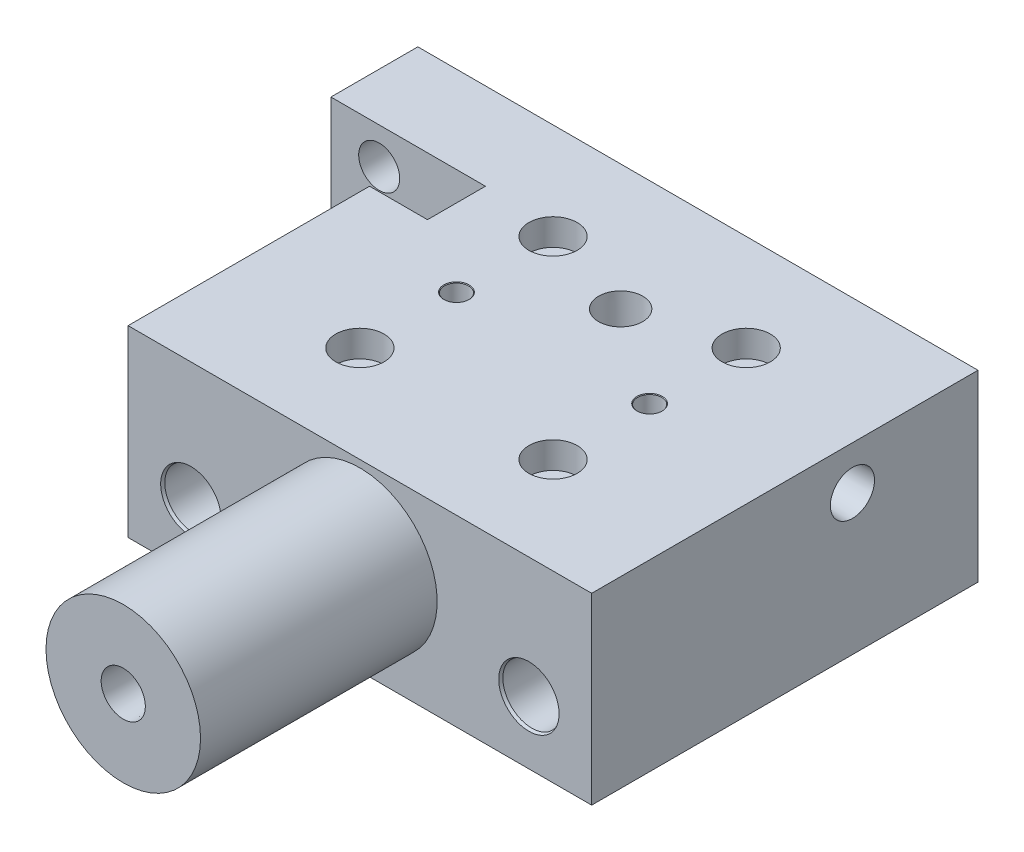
ISO-10303-21;
HEADER;
FILE_DESCRIPTION(('STEP AP214'),'2;1');
FILE_NAME('part.step','',(''),(''),'','','');
FILE_SCHEMA(('AUTOMOTIVE_DESIGN { 1 0 10303 214 1 1 1 1 }'));
ENDSEC;
DATA;
#1=APPLICATION_CONTEXT('core data for automotive mechanical design processes');
#2=APPLICATION_PROTOCOL_DEFINITION('international standard','automotive_design',2000,#1);
#3=PRODUCT_CONTEXT('',#1,'mechanical');
#4=PRODUCT('Part','Part','',(#3));
#5=PRODUCT_RELATED_PRODUCT_CATEGORY('part','',(#4));
#6=PRODUCT_DEFINITION_FORMATION('','',#4);
#7=PRODUCT_DEFINITION_CONTEXT('part definition',#1,'design');
#8=PRODUCT_DEFINITION('design','',#6,#7);
#9=PRODUCT_DEFINITION_SHAPE('','',#8);
#10=(LENGTH_UNIT() NAMED_UNIT(*) SI_UNIT(.MILLI.,.METRE.));
#11=(NAMED_UNIT(*) PLANE_ANGLE_UNIT() SI_UNIT($,.RADIAN.));
#12=(NAMED_UNIT(*) SI_UNIT($,.STERADIAN.) SOLID_ANGLE_UNIT());
#13=UNCERTAINTY_MEASURE_WITH_UNIT(LENGTH_MEASURE(1.E-05),#10,'distance_accuracy_value','');
#14=(GEOMETRIC_REPRESENTATION_CONTEXT(3) GLOBAL_UNCERTAINTY_ASSIGNED_CONTEXT((#13)) GLOBAL_UNIT_ASSIGNED_CONTEXT((#10,
#11,#12)) REPRESENTATION_CONTEXT('',''));
#15=CARTESIAN_POINT('',(0.,0.,0.));
#16=DIRECTION('',(0.,0.,1.));
#17=DIRECTION('',(1.,0.,0.));
#18=AXIS2_PLACEMENT_3D('',#15,#16,#17);
#19=CARTESIAN_POINT('',(0.,4.,-71.));
#20=DIRECTION('',(-1.,0.,0.));
#21=DIRECTION('',(0.,0.,1.));
#22=AXIS2_PLACEMENT_3D('',#19,#20,#21);
#23=CYLINDRICAL_SURFACE('',#22,2.39999999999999);
#24=CARTESIAN_POINT('',(8.99999999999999,4.,-71.));
#25=DIRECTION('',(-1.,0.,0.));
#26=DIRECTION('',(0.,0.,1.));
#27=AXIS2_PLACEMENT_3D('',#24,#25,#26);
#28=CIRCLE('',#27,2.39999999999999);
#29=CARTESIAN_POINT('',(8.99999999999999,4.,-68.6));
#30=VERTEX_POINT('',#29);
#31=EDGE_CURVE('E9355',#30,#30,#28,.T.);
#32=ORIENTED_EDGE('',*,*,#31,.F.);
#33=EDGE_LOOP('',(#32));
#34=FACE_BOUND('',#33,.T.);
#35=CARTESIAN_POINT('',(4.5,4.,-71.));
#36=DIRECTION('',(-1.,0.,0.));
#37=DIRECTION('',(0.,0.,1.));
#38=AXIS2_PLACEMENT_3D('',#35,#36,#37);
#39=CIRCLE('',#38,2.39999999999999);
#40=CARTESIAN_POINT('',(4.5,4.,-68.6));
#41=VERTEX_POINT('',#40);
#42=EDGE_CURVE('E9342',#41,#41,#39,.F.);
#43=ORIENTED_EDGE('',*,*,#42,.F.);
#44=EDGE_LOOP('',(#43));
#45=FACE_BOUND('',#44,.T.);
#46=ADVANCED_FACE('F9174',(#34,#45),#23,.F.);
#47=CARTESIAN_POINT('',(0.,38.,-80.));
#48=DIRECTION('',(1.,0.,0.));
#49=DIRECTION('',(0.,0.,-1.));
#50=AXIS2_PLACEMENT_3D('',#47,#48,#49);
#51=PLANE('',#50);
#52=CARTESIAN_POINT('',(0.,4.,-71.));
#53=DIRECTION('',(-1.,0.,0.));
#54=DIRECTION('',(0.,0.,1.));
#55=AXIS2_PLACEMENT_3D('',#52,#53,#54);
#56=CIRCLE('',#55,4.);
#57=CARTESIAN_POINT('',(0.,3.85832158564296,-67.0025098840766));
#58=VERTEX_POINT('',#57);
#59=CARTESIAN_POINT('',(0.,4.,-75.));
#60=VERTEX_POINT('',#59);
#61=EDGE_CURVE('E9321',#58,#60,#56,.T.);
#62=ORIENTED_EDGE('',*,*,#61,.F.);
#63=DIRECTION('',(0.,1.,0.));
#64=VECTOR('',#63,1.);
#65=CARTESIAN_POINT('',(0.,3.85832158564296,-67.0025098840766));
#66=LINE('',#65,#64);
#67=CARTESIAN_POINT('',(0.,0.,-67.0025098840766));
#68=VERTEX_POINT('',#67);
#69=EDGE_CURVE('E9328',#68,#58,#66,.T.);
#70=ORIENTED_EDGE('',*,*,#69,.F.);
#71=DIRECTION('',(0.,0.,1.));
#72=VECTOR('',#71,1.);
#73=CARTESIAN_POINT('',(0.,0.,-80.));
#74=LINE('',#73,#72);
#75=CARTESIAN_POINT('',(0.,0.,-62.));
#76=VERTEX_POINT('',#75);
#77=EDGE_CURVE('E9548',#68,#76,#74,.T.);
#78=ORIENTED_EDGE('',*,*,#77,.T.);
#79=DIRECTION('',(0.,-1.,0.));
#80=VECTOR('',#79,1.);
#81=CARTESIAN_POINT('',(0.,38.,-62.));
#82=LINE('',#81,#80);
#83=CARTESIAN_POINT('',(0.,38.,-62.));
#84=VERTEX_POINT('',#83);
#85=EDGE_CURVE('E9580',#84,#76,#82,.T.);
#86=ORIENTED_EDGE('',*,*,#85,.F.);
#87=DIRECTION('',(0.,0.,1.));
#88=VECTOR('',#87,1.);
#89=CARTESIAN_POINT('',(0.,38.,-80.));
#90=LINE('',#89,#88);
#91=CARTESIAN_POINT('',(0.,38.,-80.));
#92=VERTEX_POINT('',#91);
#93=EDGE_CURVE('E9565',#92,#84,#90,.T.);
#94=ORIENTED_EDGE('',*,*,#93,.F.);
#95=DIRECTION('',(0.,-1.,0.));
#96=VECTOR('',#95,1.);
#97=CARTESIAN_POINT('',(0.,38.,-80.));
#98=LINE('',#97,#96);
#99=CARTESIAN_POINT('',(0.,0.,-80.));
#100=VERTEX_POINT('',#99);
#101=EDGE_CURVE('E9583',#92,#100,#98,.T.);
#102=ORIENTED_EDGE('',*,*,#101,.T.);
#103=CARTESIAN_POINT('',(0.,0.,-75.));
#104=VERTEX_POINT('',#103);
#105=EDGE_CURVE('E9549',#100,#104,#74,.T.);
#106=ORIENTED_EDGE('',*,*,#105,.T.);
#107=DIRECTION('',(0.,-1.,0.));
#108=VECTOR('',#107,1.);
#109=CARTESIAN_POINT('',(0.,4.,-75.));
#110=LINE('',#109,#108);
#111=EDGE_CURVE('E9326',#60,#104,#110,.T.);
#112=ORIENTED_EDGE('',*,*,#111,.F.);
#113=EDGE_LOOP('',(#62,#70,#78,#86,#94,#102,#106,#112));
#114=FACE_BOUND('',#113,.T.);
#115=ADVANCED_FACE('F9645',(#114),#51,.F.);
#116=CARTESIAN_POINT('',(116.,0.,-80.));
#117=DIRECTION('',(0.,-1.,0.));
#118=DIRECTION('',(0.,0.,-1.));
#119=AXIS2_PLACEMENT_3D('',#116,#117,#118);
#120=PLANE('',#119);
#121=DIRECTION('',(-1.,0.,0.));
#122=VECTOR('',#121,1.);
#123=CARTESIAN_POINT('',(4.5,0.,-67.0025098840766));
#124=LINE('',#123,#122);
#125=CARTESIAN_POINT('',(4.5,0.,-67.0025098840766));
#126=VERTEX_POINT('',#125);
#127=EDGE_CURVE('E9343',#126,#68,#124,.T.);
#128=ORIENTED_EDGE('',*,*,#127,.F.);
#129=DIRECTION('',(0.,0.,1.));
#130=VECTOR('',#129,1.);
#131=CARTESIAN_POINT('',(4.5,0.,-75.));
#132=LINE('',#131,#130);
#133=CARTESIAN_POINT('',(4.5,0.,-75.));
#134=VERTEX_POINT('',#133);
#135=EDGE_CURVE('E9334',#134,#126,#132,.T.);
#136=ORIENTED_EDGE('',*,*,#135,.F.);
#137=DIRECTION('',(-1.,0.,0.));
#138=VECTOR('',#137,1.);
#139=CARTESIAN_POINT('',(4.5,0.,-75.));
#140=LINE('',#139,#138);
#141=EDGE_CURVE('E9345',#134,#104,#140,.T.);
#142=ORIENTED_EDGE('',*,*,#141,.T.);
#143=ORIENTED_EDGE('',*,*,#105,.F.);
#144=DIRECTION('',(-1.,0.,0.));
#145=VECTOR('',#144,1.);
#146=CARTESIAN_POINT('',(0.,0.,-80.));
#147=LINE('',#146,#145);
#148=CARTESIAN_POINT('',(8.99999999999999,0.,-80.));
#149=VERTEX_POINT('',#148);
#150=EDGE_CURVE('E9544',#149,#100,#147,.T.);
#151=ORIENTED_EDGE('',*,*,#150,.F.);
#152=DIRECTION('',(0.,0.,-1.));
#153=VECTOR('',#152,1.);
#154=CARTESIAN_POINT('',(8.99999999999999,0.,-61.));
#155=LINE('',#154,#153);
#156=CARTESIAN_POINT('',(8.99999999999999,0.,-62.));
#157=VERTEX_POINT('',#156);
#158=EDGE_CURVE('E9358',#157,#149,#155,.T.);
#159=ORIENTED_EDGE('',*,*,#158,.F.);
#160=DIRECTION('',(1.,0.,0.));
#161=VECTOR('',#160,1.);
#162=CARTESIAN_POINT('',(0.,0.,-62.));
#163=LINE('',#162,#161);
#164=EDGE_CURVE('E9553',#76,#157,#163,.T.);
#165=ORIENTED_EDGE('',*,*,#164,.F.);
#166=ORIENTED_EDGE('',*,*,#77,.F.);
#167=EDGE_LOOP('',(#128,#136,#142,#143,#151,#159,#165,#166));
#168=FACE_BOUND('',#167,.T.);
#169=ADVANCED_FACE('F9652',(#168),#120,.T.);
#170=CARTESIAN_POINT('',(20.,38.,0.));
#171=DIRECTION('',(0.,0.,-1.));
#172=DIRECTION('',(-1.,0.,0.));
#173=AXIS2_PLACEMENT_3D('',#170,#171,#172);
#174=PLANE('',#173);
#175=DIRECTION('',(1.,0.,0.));
#176=VECTOR('',#175,1.);
#177=CARTESIAN_POINT('',(20.,0.,0.));
#178=LINE('',#177,#176);
#179=CARTESIAN_POINT('',(20.,0.,0.));
#180=VERTEX_POINT('',#179);
#181=CARTESIAN_POINT('',(116.,0.,0.));
#182=VERTEX_POINT('',#181);
#183=EDGE_CURVE('E9558',#180,#182,#178,.T.);
#184=ORIENTED_EDGE('',*,*,#183,.T.);
#185=DIRECTION('',(0.,-1.,0.));
#186=VECTOR('',#185,1.);
#187=CARTESIAN_POINT('',(116.,38.,0.));
#188=LINE('',#187,#186);
#189=CARTESIAN_POINT('',(116.,38.,0.));
#190=VERTEX_POINT('',#189);
#191=EDGE_CURVE('E9572',#190,#182,#188,.T.);
#192=ORIENTED_EDGE('',*,*,#191,.F.);
#193=DIRECTION('',(1.,0.,0.));
#194=VECTOR('',#193,1.);
#195=CARTESIAN_POINT('',(20.,38.,0.));
#196=LINE('',#195,#194);
#197=CARTESIAN_POINT('',(20.,38.,0.));
#198=VERTEX_POINT('',#197);
#199=EDGE_CURVE('E9570',#198,#190,#196,.T.);
#200=ORIENTED_EDGE('',*,*,#199,.F.);
#201=DIRECTION('',(0.,-1.,0.));
#202=VECTOR('',#201,1.);
#203=CARTESIAN_POINT('',(20.,38.,0.));
#204=LINE('',#203,#202);
#205=EDGE_CURVE('E9575',#198,#180,#204,.T.);
#206=ORIENTED_EDGE('',*,*,#205,.T.);
#207=EDGE_LOOP('',(#184,#192,#200,#206));
#208=FACE_BOUND('',#207,.T.);
#209=CARTESIAN_POINT('',(33.,13.,0.));
#210=DIRECTION('',(0.,0.,1.));
#211=DIRECTION('',(1.,0.,0.));
#212=AXIS2_PLACEMENT_3D('',#209,#210,#211);
#213=CIRCLE('',#212,6.25);
#214=CARTESIAN_POINT('',(39.25,13.,0.));
#215=VERTEX_POINT('',#214);
#216=EDGE_CURVE('E9526',#215,#215,#213,.T.);
#217=ORIENTED_EDGE('',*,*,#216,.F.);
#218=EDGE_LOOP('',(#217));
#219=FACE_BOUND('',#218,.T.);
#220=CARTESIAN_POINT('',(103.,13.,0.));
#221=DIRECTION('',(0.,0.,1.));
#222=DIRECTION('',(1.,0.,0.));
#223=AXIS2_PLACEMENT_3D('',#220,#221,#222);
#224=CIRCLE('',#223,6.25000000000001);
#225=CARTESIAN_POINT('',(109.25,13.,0.));
#226=VERTEX_POINT('',#225);
#227=EDGE_CURVE('E9514',#226,#226,#224,.T.);
#228=ORIENTED_EDGE('',*,*,#227,.F.);
#229=EDGE_LOOP('',(#228));
#230=FACE_BOUND('',#229,.T.);
#231=CARTESIAN_POINT('',(68.,20.5,0.));
#232=DIRECTION('',(0.,0.,-1.));
#233=DIRECTION('',(-1.,0.,0.));
#234=AXIS2_PLACEMENT_3D('',#231,#232,#233);
#235=CIRCLE('',#234,16.);
#236=CARTESIAN_POINT('',(52.,20.5,0.));
#237=VERTEX_POINT('',#236);
#238=EDGE_CURVE('E9589',#237,#237,#235,.F.);
#239=ORIENTED_EDGE('',*,*,#238,.F.);
#240=EDGE_LOOP('',(#239));
#241=FACE_BOUND('',#240,.T.);
#242=ADVANCED_FACE('F9626',(#208,#219,#230,#241),#174,.F.);
#243=DIRECTION('',(0.,0.,1.));
#244=VECTOR('',#243,1.);
#245=CARTESIAN_POINT('',(11.,0.,-61.));
#246=LINE('',#245,#244);
#247=CARTESIAN_POINT('',(11.,0.,-80.));
#248=VERTEX_POINT('',#247);
#249=CARTESIAN_POINT('',(11.,0.,-62.));
#250=VERTEX_POINT('',#249);
#251=EDGE_CURVE('E9360',#248,#250,#246,.T.);
#252=ORIENTED_EDGE('',*,*,#251,.F.);
#253=CARTESIAN_POINT('',(116.,0.,-80.));
#254=VERTEX_POINT('',#253);
#255=EDGE_CURVE('E9545',#254,#248,#147,.T.);
#256=ORIENTED_EDGE('',*,*,#255,.F.);
#257=DIRECTION('',(0.,0.,-1.));
#258=VECTOR('',#257,1.);
#259=CARTESIAN_POINT('',(116.,0.,0.));
#260=LINE('',#259,#258);
#261=EDGE_CURVE('E9541',#182,#254,#260,.T.);
#262=ORIENTED_EDGE('',*,*,#261,.F.);
#263=ORIENTED_EDGE('',*,*,#183,.F.);
#264=DIRECTION('',(0.,0.,1.));
#265=VECTOR('',#264,1.);
#266=CARTESIAN_POINT('',(20.,0.,-62.));
#267=LINE('',#266,#265);
#268=CARTESIAN_POINT('',(20.,0.,-62.));
#269=VERTEX_POINT('',#268);
#270=EDGE_CURVE('E9556',#269,#180,#267,.T.);
#271=ORIENTED_EDGE('',*,*,#270,.F.);
#272=EDGE_CURVE('E9552',#250,#269,#163,.T.);
#273=ORIENTED_EDGE('',*,*,#272,.F.);
#274=EDGE_LOOP('',(#252,#256,#262,#263,#271,#273));
#275=FACE_BOUND('',#274,.T.);
#276=CARTESIAN_POINT('',(68.,0.,-54.));
#277=DIRECTION('',(0.,-1.,0.));
#278=DIRECTION('',(0.,0.,-1.));
#279=AXIS2_PLACEMENT_3D('',#276,#277,#278);
#280=CIRCLE('',#279,4.57349999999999);
#281=CARTESIAN_POINT('',(68.,0.,-58.5735));
#282=VERTEX_POINT('',#281);
#283=EDGE_CURVE('E9422',#282,#282,#280,.T.);
#284=ORIENTED_EDGE('',*,*,#283,.F.);
#285=EDGE_LOOP('',(#284));
#286=FACE_BOUND('',#285,.T.);
#287=CARTESIAN_POINT('',(48.,0.,-20.));
#288=DIRECTION('',(0.,-1.,0.));
#289=DIRECTION('',(0.,0.,-1.));
#290=AXIS2_PLACEMENT_3D('',#287,#288,#289);
#291=CIRCLE('',#290,5.);
#292=CARTESIAN_POINT('',(48.,0.,-25.));
#293=VERTEX_POINT('',#292);
#294=EDGE_CURVE('E9425',#293,#293,#291,.T.);
#295=ORIENTED_EDGE('',*,*,#294,.F.);
#296=EDGE_LOOP('',(#295));
#297=FACE_BOUND('',#296,.T.);
#298=CARTESIAN_POINT('',(48.,0.,-60.));
#299=DIRECTION('',(0.,-1.,0.));
#300=DIRECTION('',(0.,0.,-1.));
#301=AXIS2_PLACEMENT_3D('',#298,#299,#300);
#302=CIRCLE('',#301,5.);
#303=CARTESIAN_POINT('',(48.,0.,-65.));
#304=VERTEX_POINT('',#303);
#305=EDGE_CURVE('E9453',#304,#304,#302,.T.);
#306=ORIENTED_EDGE('',*,*,#305,.F.);
#307=EDGE_LOOP('',(#306));
#308=FACE_BOUND('',#307,.T.);
#309=CARTESIAN_POINT('',(88.,0.,-40.));
#310=DIRECTION('',(0.,-1.,0.));
#311=DIRECTION('',(0.,0.,-1.));
#312=AXIS2_PLACEMENT_3D('',#309,#310,#311);
#313=CIRCLE('',#312,2.625);
#314=CARTESIAN_POINT('',(88.,0.,-42.625));
#315=VERTEX_POINT('',#314);
#316=EDGE_CURVE('E9490',#315,#315,#313,.T.);
#317=ORIENTED_EDGE('',*,*,#316,.F.);
#318=EDGE_LOOP('',(#317));
#319=FACE_BOUND('',#318,.T.);
#320=CARTESIAN_POINT('',(48.,0.,-40.));
#321=DIRECTION('',(0.,-1.,0.));
#322=DIRECTION('',(0.,0.,-1.));
#323=AXIS2_PLACEMENT_3D('',#320,#321,#322);
#324=CIRCLE('',#323,2.625);
#325=CARTESIAN_POINT('',(48.,0.,-42.625));
#326=VERTEX_POINT('',#325);
#327=EDGE_CURVE('E9502',#326,#326,#324,.T.);
#328=ORIENTED_EDGE('',*,*,#327,.F.);
#329=EDGE_LOOP('',(#328));
#330=FACE_BOUND('',#329,.T.);
#331=CARTESIAN_POINT('',(88.,0.,-60.));
#332=DIRECTION('',(0.,-1.,0.));
#333=DIRECTION('',(0.,0.,-1.));
#334=AXIS2_PLACEMENT_3D('',#331,#332,#333);
#335=CIRCLE('',#334,5.);
#336=CARTESIAN_POINT('',(88.,0.,-65.));
#337=VERTEX_POINT('',#336);
#338=EDGE_CURVE('E9467',#337,#337,#335,.T.);
#339=ORIENTED_EDGE('',*,*,#338,.F.);
#340=EDGE_LOOP('',(#339));
#341=FACE_BOUND('',#340,.T.);
#342=CARTESIAN_POINT('',(88.,0.,-20.));
#343=DIRECTION('',(0.,-1.,0.));
#344=DIRECTION('',(0.,0.,-1.));
#345=AXIS2_PLACEMENT_3D('',#342,#343,#344);
#346=CIRCLE('',#345,5.);
#347=CARTESIAN_POINT('',(88.,0.,-25.));
#348=VERTEX_POINT('',#347);
#349=EDGE_CURVE('E9439',#348,#348,#346,.T.);
#350=ORIENTED_EDGE('',*,*,#349,.F.);
#351=EDGE_LOOP('',(#350));
#352=FACE_BOUND('',#351,.T.);
#353=ADVANCED_FACE('F9631',(#275,#286,#297,#308,#319,#330,#341,#352),#120,.T.);
#354=CARTESIAN_POINT('',(116.,38.,0.));
#355=DIRECTION('',(-1.,0.,0.));
#356=DIRECTION('',(0.,0.,1.));
#357=AXIS2_PLACEMENT_3D('',#354,#355,#356);
#358=PLANE('',#357);
#359=CARTESIAN_POINT('',(116.,29.,-54.));
#360=DIRECTION('',(1.,0.,0.));
#361=DIRECTION('',(0.,0.,-1.));
#362=AXIS2_PLACEMENT_3D('',#359,#360,#361);
#363=CIRCLE('',#362,4.5735);
#364=CARTESIAN_POINT('',(116.,29.,-58.5735));
#365=VERTEX_POINT('',#364);
#366=EDGE_CURVE('E9398',#365,#365,#363,.T.);
#367=ORIENTED_EDGE('',*,*,#366,.F.);
#368=EDGE_LOOP('',(#367));
#369=FACE_BOUND('',#368,.T.);
#370=ORIENTED_EDGE('',*,*,#261,.T.);
#371=DIRECTION('',(0.,-1.,0.));
#372=VECTOR('',#371,1.);
#373=CARTESIAN_POINT('',(116.,38.,-80.));
#374=LINE('',#373,#372);
#375=CARTESIAN_POINT('',(116.,38.,-80.));
#376=VERTEX_POINT('',#375);
#377=EDGE_CURVE('E9586',#376,#254,#374,.T.);
#378=ORIENTED_EDGE('',*,*,#377,.F.);
#379=DIRECTION('',(0.,0.,-1.));
#380=VECTOR('',#379,1.);
#381=CARTESIAN_POINT('',(116.,38.,0.));
#382=LINE('',#381,#380);
#383=EDGE_CURVE('E9560',#190,#376,#382,.T.);
#384=ORIENTED_EDGE('',*,*,#383,.F.);
#385=ORIENTED_EDGE('',*,*,#191,.T.);
#386=EDGE_LOOP('',(#370,#378,#384,#385));
#387=FACE_BOUND('',#386,.T.);
#388=ADVANCED_FACE('F9176',(#369,#387),#358,.F.);
#389=CARTESIAN_POINT('',(0.,38.,-80.));
#390=DIRECTION('',(0.,0.,1.));
#391=DIRECTION('',(1.,0.,0.));
#392=AXIS2_PLACEMENT_3D('',#389,#390,#391);
#393=PLANE('',#392);
#394=CARTESIAN_POINT('',(103.,13.,-80.));
#395=DIRECTION('',(0.,0.,1.));
#396=DIRECTION('',(1.,0.,0.));
#397=AXIS2_PLACEMENT_3D('',#394,#395,#396);
#398=CIRCLE('',#397,6.24999999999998);
#399=CARTESIAN_POINT('',(109.25,13.,-80.));
#400=VERTEX_POINT('',#399);
#401=EDGE_CURVE('E9505',#400,#400,#398,.T.);
#402=ORIENTED_EDGE('',*,*,#401,.T.);
#403=EDGE_LOOP('',(#402));
#404=FACE_BOUND('',#403,.T.);
#405=CARTESIAN_POINT('',(33.,13.,-80.));
#406=DIRECTION('',(0.,0.,1.));
#407=DIRECTION('',(1.,0.,0.));
#408=AXIS2_PLACEMENT_3D('',#405,#406,#407);
#409=CIRCLE('',#408,6.24999999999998);
#410=CARTESIAN_POINT('',(39.25,13.,-80.));
#411=VERTEX_POINT('',#410);
#412=EDGE_CURVE('E9517',#411,#411,#409,.T.);
#413=ORIENTED_EDGE('',*,*,#412,.T.);
#414=EDGE_LOOP('',(#413));
#415=FACE_BOUND('',#414,.T.);
#416=CARTESIAN_POINT('',(9.99999999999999,30.5,-80.));
#417=DIRECTION('',(0.,0.,1.));
#418=DIRECTION('',(1.,0.,0.));
#419=AXIS2_PLACEMENT_3D('',#416,#417,#418);
#420=CIRCLE('',#419,4.24999999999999);
#421=CARTESIAN_POINT('',(14.25,30.5,-80.));
#422=VERTEX_POINT('',#421);
#423=EDGE_CURVE('E9529',#422,#422,#420,.T.);
#424=ORIENTED_EDGE('',*,*,#423,.T.);
#425=EDGE_LOOP('',(#424));
#426=FACE_BOUND('',#425,.T.);
#427=CARTESIAN_POINT('',(9.99999999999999,13.5,-80.));
#428=DIRECTION('',(0.,0.,1.));
#429=DIRECTION('',(1.,0.,0.));
#430=AXIS2_PLACEMENT_3D('',#427,#428,#429);
#431=CIRCLE('',#430,6.);
#432=CARTESIAN_POINT('',(11.,7.58392021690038,-80.));
#433=VERTEX_POINT('',#432);
#434=CARTESIAN_POINT('',(8.99999999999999,7.58392021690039,-80.));
#435=VERTEX_POINT('',#434);
#436=EDGE_CURVE('E9535',#433,#435,#431,.T.);
#437=ORIENTED_EDGE('',*,*,#436,.T.);
#438=DIRECTION('',(0.,-1.,0.));
#439=VECTOR('',#438,1.);
#440=CARTESIAN_POINT('',(8.99999999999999,38.,-80.));
#441=LINE('',#440,#439);
#442=EDGE_CURVE('E9371',#435,#149,#441,.T.);
#443=ORIENTED_EDGE('',*,*,#442,.T.);
#444=ORIENTED_EDGE('',*,*,#150,.T.);
#445=ORIENTED_EDGE('',*,*,#101,.F.);
#446=DIRECTION('',(-1.,0.,0.));
#447=VECTOR('',#446,1.);
#448=CARTESIAN_POINT('',(0.,38.,-80.));
#449=LINE('',#448,#447);
#450=EDGE_CURVE('E9563',#376,#92,#449,.T.);
#451=ORIENTED_EDGE('',*,*,#450,.F.);
#452=ORIENTED_EDGE('',*,*,#377,.T.);
#453=ORIENTED_EDGE('',*,*,#255,.T.);
#454=DIRECTION('',(0.,1.,0.));
#455=VECTOR('',#454,1.);
#456=CARTESIAN_POINT('',(11.,38.,-80.));
#457=LINE('',#456,#455);
#458=EDGE_CURVE('E9365',#248,#433,#457,.T.);
#459=ORIENTED_EDGE('',*,*,#458,.T.);
#460=EDGE_LOOP('',(#437,#443,#444,#445,#451,#452,#453,#459));
#461=FACE_BOUND('',#460,.T.);
#462=ADVANCED_FACE('F9640',(#404,#415,#426,#461),#393,.F.);
#463=CARTESIAN_POINT('',(0.,38.,-62.));
#464=DIRECTION('',(0.,0.,-1.));
#465=DIRECTION('',(-1.,0.,0.));
#466=AXIS2_PLACEMENT_3D('',#463,#464,#465);
#467=PLANE('',#466);
#468=CARTESIAN_POINT('',(9.99999999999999,30.5,-62.));
#469=DIRECTION('',(0.,0.,1.));
#470=DIRECTION('',(1.,0.,0.));
#471=AXIS2_PLACEMENT_3D('',#468,#469,#470);
#472=CIRCLE('',#471,4.24999999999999);
#473=CARTESIAN_POINT('',(14.25,30.5,-62.));
#474=VERTEX_POINT('',#473);
#475=EDGE_CURVE('E9532',#474,#474,#472,.T.);
#476=ORIENTED_EDGE('',*,*,#475,.F.);
#477=EDGE_LOOP('',(#476));
#478=FACE_BOUND('',#477,.T.);
#479=DIRECTION('',(0.,-1.,0.));
#480=VECTOR('',#479,1.);
#481=CARTESIAN_POINT('',(20.,38.,-62.));
#482=LINE('',#481,#480);
#483=CARTESIAN_POINT('',(20.,26.,-62.));
#484=VERTEX_POINT('',#483);
#485=EDGE_CURVE('E9578',#484,#269,#482,.T.);
#486=ORIENTED_EDGE('',*,*,#485,.F.);
#487=DIRECTION('',(-0.707106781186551,-0.707106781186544,0.));
#488=VECTOR('',#487,1.);
#489=CARTESIAN_POINT('',(19.9999999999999,26.,-62.));
#490=LINE('',#489,#488);
#491=CARTESIAN_POINT('',(32.,38.,-62.));
#492=VERTEX_POINT('',#491);
#493=EDGE_CURVE('E9182',#484,#492,#490,.F.);
#494=ORIENTED_EDGE('',*,*,#493,.T.);
#495=DIRECTION('',(1.,0.,0.));
#496=VECTOR('',#495,1.);
#497=CARTESIAN_POINT('',(0.,38.,-62.));
#498=LINE('',#497,#496);
#499=EDGE_CURVE('E9311',#84,#492,#498,.T.);
#500=ORIENTED_EDGE('',*,*,#499,.F.);
#501=ORIENTED_EDGE('',*,*,#85,.T.);
#502=ORIENTED_EDGE('',*,*,#164,.T.);
#503=DIRECTION('',(0.,1.,0.));
#504=VECTOR('',#503,1.);
#505=CARTESIAN_POINT('',(8.99999999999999,38.,-62.));
#506=LINE('',#505,#504);
#507=CARTESIAN_POINT('',(8.99999999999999,7.58392021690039,-62.));
#508=VERTEX_POINT('',#507);
#509=EDGE_CURVE('E9368',#157,#508,#506,.T.);
#510=ORIENTED_EDGE('',*,*,#509,.T.);
#511=CARTESIAN_POINT('',(9.99999999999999,13.5,-62.));
#512=DIRECTION('',(0.,0.,1.));
#513=DIRECTION('',(1.,0.,0.));
#514=AXIS2_PLACEMENT_3D('',#511,#512,#513);
#515=CIRCLE('',#514,6.);
#516=CARTESIAN_POINT('',(11.,7.58392021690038,-62.));
#517=VERTEX_POINT('',#516);
#518=EDGE_CURVE('E9538',#517,#508,#515,.T.);
#519=ORIENTED_EDGE('',*,*,#518,.F.);
#520=DIRECTION('',(0.,-1.,0.));
#521=VECTOR('',#520,1.);
#522=CARTESIAN_POINT('',(11.,38.,-62.));
#523=LINE('',#522,#521);
#524=EDGE_CURVE('E9362',#517,#250,#523,.T.);
#525=ORIENTED_EDGE('',*,*,#524,.T.);
#526=ORIENTED_EDGE('',*,*,#272,.T.);
#527=EDGE_LOOP('',(#486,#494,#500,#501,#502,#510,#519,#525,#526));
#528=FACE_BOUND('',#527,.T.);
#529=ADVANCED_FACE('F9616',(#478,#528),#467,.F.);
#530=CARTESIAN_POINT('',(20.,38.,-62.));
#531=DIRECTION('',(1.,0.,0.));
#532=DIRECTION('',(0.,0.,-1.));
#533=AXIS2_PLACEMENT_3D('',#530,#531,#532);
#534=PLANE('',#533);
#535=DIRECTION('',(0.,0.,1.));
#536=VECTOR('',#535,1.);
#537=CARTESIAN_POINT('',(20.,38.,-62.));
#538=LINE('',#537,#536);
#539=CARTESIAN_POINT('',(20.,38.,-50.));
#540=VERTEX_POINT('',#539);
#541=EDGE_CURVE('E9568',#540,#198,#538,.T.);
#542=ORIENTED_EDGE('',*,*,#541,.F.);
#543=DIRECTION('',(0.,1.,0.));
#544=VECTOR('',#543,1.);
#545=CARTESIAN_POINT('',(20.,26.,-50.));
#546=LINE('',#545,#544);
#547=CARTESIAN_POINT('',(20.,26.,-50.));
#548=VERTEX_POINT('',#547);
#549=EDGE_CURVE('E9188',#548,#540,#546,.T.);
#550=ORIENTED_EDGE('',*,*,#549,.F.);
#551=DIRECTION('',(0.,0.,1.));
#552=VECTOR('',#551,1.);
#553=CARTESIAN_POINT('',(20.,26.,-50.));
#554=LINE('',#553,#552);
#555=EDGE_CURVE('E9313',#484,#548,#554,.T.);
#556=ORIENTED_EDGE('',*,*,#555,.F.);
#557=ORIENTED_EDGE('',*,*,#485,.T.);
#558=ORIENTED_EDGE('',*,*,#270,.T.);
#559=ORIENTED_EDGE('',*,*,#205,.F.);
#560=EDGE_LOOP('',(#542,#550,#556,#557,#558,#559));
#561=FACE_BOUND('',#560,.T.);
#562=ADVANCED_FACE('F9620',(#561),#534,.F.);
#563=CARTESIAN_POINT('',(116.,38.,-80.));
#564=DIRECTION('',(0.,-1.,0.));
#565=DIRECTION('',(0.,0.,-1.));
#566=AXIS2_PLACEMENT_3D('',#563,#564,#565);
#567=PLANE('',#566);
#568=CARTESIAN_POINT('',(68.,38.,-54.));
#569=DIRECTION('',(0.,1.,0.));
#570=DIRECTION('',(0.,0.,1.));
#571=AXIS2_PLACEMENT_3D('',#568,#569,#570);
#572=CIRCLE('',#571,4.57349999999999);
#573=CARTESIAN_POINT('',(68.,38.,-49.4265));
#574=VERTEX_POINT('',#573);
#575=EDGE_CURVE('E9401',#574,#574,#572,.T.);
#576=ORIENTED_EDGE('',*,*,#575,.F.);
#577=EDGE_LOOP('',(#576));
#578=FACE_BOUND('',#577,.T.);
#579=CARTESIAN_POINT('',(48.,38.,-20.));
#580=DIRECTION('',(0.,1.,0.));
#581=DIRECTION('',(0.,0.,1.));
#582=AXIS2_PLACEMENT_3D('',#579,#580,#581);
#583=CIRCLE('',#582,5.);
#584=CARTESIAN_POINT('',(48.,38.,-15.));
#585=VERTEX_POINT('',#584);
#586=EDGE_CURVE('E9432',#585,#585,#583,.T.);
#587=ORIENTED_EDGE('',*,*,#586,.F.);
#588=EDGE_LOOP('',(#587));
#589=FACE_BOUND('',#588,.T.);
#590=CARTESIAN_POINT('',(88.,38.,-20.));
#591=DIRECTION('',(0.,1.,0.));
#592=DIRECTION('',(0.,0.,1.));
#593=AXIS2_PLACEMENT_3D('',#590,#591,#592);
#594=CIRCLE('',#593,5.);
#595=CARTESIAN_POINT('',(88.,38.,-15.));
#596=VERTEX_POINT('',#595);
#597=EDGE_CURVE('E9446',#596,#596,#594,.T.);
#598=ORIENTED_EDGE('',*,*,#597,.F.);
#599=EDGE_LOOP('',(#598));
#600=FACE_BOUND('',#599,.T.);
#601=CARTESIAN_POINT('',(48.,38.,-60.));
#602=DIRECTION('',(0.,1.,0.));
#603=DIRECTION('',(0.,0.,1.));
#604=AXIS2_PLACEMENT_3D('',#601,#602,#603);
#605=CIRCLE('',#604,5.);
#606=CARTESIAN_POINT('',(48.,38.,-55.));
#607=VERTEX_POINT('',#606);
#608=EDGE_CURVE('E9460',#607,#607,#605,.T.);
#609=ORIENTED_EDGE('',*,*,#608,.F.);
#610=EDGE_LOOP('',(#609));
#611=FACE_BOUND('',#610,.T.);
#612=CARTESIAN_POINT('',(88.,38.,-60.));
#613=DIRECTION('',(0.,1.,0.));
#614=DIRECTION('',(0.,0.,1.));
#615=AXIS2_PLACEMENT_3D('',#612,#613,#614);
#616=CIRCLE('',#615,5.);
#617=CARTESIAN_POINT('',(88.,38.,-55.));
#618=VERTEX_POINT('',#617);
#619=EDGE_CURVE('E9477',#618,#618,#616,.T.);
#620=ORIENTED_EDGE('',*,*,#619,.F.);
#621=EDGE_LOOP('',(#620));
#622=FACE_BOUND('',#621,.T.);
#623=CARTESIAN_POINT('',(88.,38.,-40.));
#624=DIRECTION('',(0.,-1.,0.));
#625=DIRECTION('',(0.,0.,-1.));
#626=AXIS2_PLACEMENT_3D('',#623,#624,#625);
#627=CIRCLE('',#626,2.62499999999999);
#628=CARTESIAN_POINT('',(88.,38.,-42.625));
#629=VERTEX_POINT('',#628);
#630=EDGE_CURVE('E9481',#629,#629,#627,.T.);
#631=ORIENTED_EDGE('',*,*,#630,.T.);
#632=EDGE_LOOP('',(#631));
#633=FACE_BOUND('',#632,.T.);
#634=CARTESIAN_POINT('',(48.,38.,-40.));
#635=DIRECTION('',(0.,-1.,0.));
#636=DIRECTION('',(0.,0.,-1.));
#637=AXIS2_PLACEMENT_3D('',#634,#635,#636);
#638=CIRCLE('',#637,2.62499999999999);
#639=CARTESIAN_POINT('',(48.,38.,-42.625));
#640=VERTEX_POINT('',#639);
#641=EDGE_CURVE('E9493',#640,#640,#638,.T.);
#642=ORIENTED_EDGE('',*,*,#641,.T.);
#643=EDGE_LOOP('',(#642));
#644=FACE_BOUND('',#643,.T.);
#645=ORIENTED_EDGE('',*,*,#499,.T.);
#646=DIRECTION('',(0.,0.,-1.));
#647=VECTOR('',#646,1.);
#648=CARTESIAN_POINT('',(32.,38.,-62.));
#649=LINE('',#648,#647);
#650=CARTESIAN_POINT('',(32.,38.,-50.));
#651=VERTEX_POINT('',#650);
#652=EDGE_CURVE('E9305',#651,#492,#649,.T.);
#653=ORIENTED_EDGE('',*,*,#652,.F.);
#654=DIRECTION('',(1.,0.,0.));
#655=VECTOR('',#654,1.);
#656=CARTESIAN_POINT('',(32.,38.,-50.));
#657=LINE('',#656,#655);
#658=EDGE_CURVE('E9299',#540,#651,#657,.T.);
#659=ORIENTED_EDGE('',*,*,#658,.F.);
#660=ORIENTED_EDGE('',*,*,#541,.T.);
#661=ORIENTED_EDGE('',*,*,#199,.T.);
#662=ORIENTED_EDGE('',*,*,#383,.T.);
#663=ORIENTED_EDGE('',*,*,#450,.T.);
#664=ORIENTED_EDGE('',*,*,#93,.T.);
#665=EDGE_LOOP('',(#645,#653,#659,#660,#661,#662,#663,#664));
#666=FACE_BOUND('',#665,.T.);
#667=ADVANCED_FACE('F9309',(#578,#589,#600,#611,#622,#633,#644,#666),#567,.F.);
#668=CARTESIAN_POINT('',(9.99999999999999,13.5,-62.));
#669=DIRECTION('',(0.,0.,1.));
#670=DIRECTION('',(1.,0.,0.));
#671=AXIS2_PLACEMENT_3D('',#668,#669,#670);
#672=CYLINDRICAL_SURFACE('',#671,6.);
#673=ORIENTED_EDGE('',*,*,#518,.T.);
#674=DIRECTION('',(0.,0.,1.));
#675=VECTOR('',#674,1.);
#676=CARTESIAN_POINT('',(8.99999999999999,7.58392021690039,-62.));
#677=LINE('',#676,#675);
#678=EDGE_CURVE('E9611',#508,#435,#677,.F.);
#679=ORIENTED_EDGE('',*,*,#678,.T.);
#680=ORIENTED_EDGE('',*,*,#436,.F.);
#681=DIRECTION('',(0.,0.,1.));
#682=VECTOR('',#681,1.);
#683=CARTESIAN_POINT('',(11.,7.58392021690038,-62.));
#684=LINE('',#683,#682);
#685=EDGE_CURVE('E9608',#433,#517,#684,.T.);
#686=ORIENTED_EDGE('',*,*,#685,.T.);
#687=EDGE_LOOP('',(#673,#679,#680,#686));
#688=FACE_BOUND('',#687,.T.);
#689=ADVANCED_FACE('F9657',(#688),#672,.F.);
#690=CARTESIAN_POINT('',(9.99999999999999,30.5,-62.));
#691=DIRECTION('',(0.,0.,1.));
#692=DIRECTION('',(1.,0.,0.));
#693=AXIS2_PLACEMENT_3D('',#690,#691,#692);
#694=CYLINDRICAL_SURFACE('',#693,4.24999999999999);
#695=ORIENTED_EDGE('',*,*,#423,.F.);
#696=EDGE_LOOP('',(#695));
#697=FACE_BOUND('',#696,.T.);
#698=ORIENTED_EDGE('',*,*,#475,.T.);
#699=EDGE_LOOP('',(#698));
#700=FACE_BOUND('',#699,.T.);
#701=ADVANCED_FACE('F9789',(#697,#700),#694,.F.);
#702=CARTESIAN_POINT('',(33.,13.,0.));
#703=DIRECTION('',(0.,0.,1.));
#704=DIRECTION('',(1.,0.,0.));
#705=AXIS2_PLACEMENT_3D('',#702,#703,#704);
#706=CONICAL_SURFACE('',#705,6.25,0.392699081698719);
#707=CARTESIAN_POINT('',(33.,13.,-0.6035533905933));
#708=DIRECTION('',(0.,0.,1.));
#709=DIRECTION('',(1.,0.,0.));
#710=AXIS2_PLACEMENT_3D('',#707,#708,#709);
#711=CIRCLE('',#710,5.99999999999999);
#712=CARTESIAN_POINT('',(39.,13.,-0.6035533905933));
#713=VERTEX_POINT('',#712);
#714=EDGE_CURVE('E9523',#713,#713,#711,.T.);
#715=ORIENTED_EDGE('',*,*,#714,.F.);
#716=EDGE_LOOP('',(#715));
#717=FACE_BOUND('',#716,.T.);
#718=ORIENTED_EDGE('',*,*,#216,.T.);
#719=EDGE_LOOP('',(#718));
#720=FACE_BOUND('',#719,.T.);
#721=ADVANCED_FACE('F10199',(#717,#720),#706,.F.);
#722=CARTESIAN_POINT('',(33.,13.,0.));
#723=DIRECTION('',(0.,0.,1.));
#724=DIRECTION('',(1.,0.,0.));
#725=AXIS2_PLACEMENT_3D('',#722,#723,#724);
#726=CYLINDRICAL_SURFACE('',#725,5.99999999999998);
#727=CARTESIAN_POINT('',(33.,13.,-79.3964466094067));
#728=DIRECTION('',(0.,0.,1.));
#729=DIRECTION('',(1.,0.,0.));
#730=AXIS2_PLACEMENT_3D('',#727,#728,#729);
#731=CIRCLE('',#730,5.99999999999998);
#732=CARTESIAN_POINT('',(39.,13.,-79.3964466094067));
#733=VERTEX_POINT('',#732);
#734=EDGE_CURVE('E9520',#733,#733,#731,.T.);
#735=ORIENTED_EDGE('',*,*,#734,.F.);
#736=EDGE_LOOP('',(#735));
#737=FACE_BOUND('',#736,.T.);
#738=ORIENTED_EDGE('',*,*,#714,.T.);
#739=EDGE_LOOP('',(#738));
#740=FACE_BOUND('',#739,.T.);
#741=ADVANCED_FACE('F10191',(#737,#740),#726,.F.);
#742=CARTESIAN_POINT('',(33.,13.,-79.3964466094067));
#743=DIRECTION('',(0.,0.,-1.));
#744=DIRECTION('',(-1.,0.,0.));
#745=AXIS2_PLACEMENT_3D('',#742,#743,#744);
#746=CONICAL_SURFACE('',#745,5.99999999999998,0.392699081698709);
#747=ORIENTED_EDGE('',*,*,#412,.F.);
#748=EDGE_LOOP('',(#747));
#749=FACE_BOUND('',#748,.T.);
#750=ORIENTED_EDGE('',*,*,#734,.T.);
#751=EDGE_LOOP('',(#750));
#752=FACE_BOUND('',#751,.T.);
#753=ADVANCED_FACE('F10183',(#749,#752),#746,.F.);
#754=CARTESIAN_POINT('',(103.,13.,0.));
#755=DIRECTION('',(0.,0.,1.));
#756=DIRECTION('',(1.,0.,0.));
#757=AXIS2_PLACEMENT_3D('',#754,#755,#756);
#758=CONICAL_SURFACE('',#757,6.25000000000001,0.392699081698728);
#759=CARTESIAN_POINT('',(103.,13.,-0.6035533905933));
#760=DIRECTION('',(0.,0.,1.));
#761=DIRECTION('',(1.,0.,0.));
#762=AXIS2_PLACEMENT_3D('',#759,#760,#761);
#763=CIRCLE('',#762,5.99999999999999);
#764=CARTESIAN_POINT('',(109.,13.,-0.6035533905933));
#765=VERTEX_POINT('',#764);
#766=EDGE_CURVE('E9511',#765,#765,#763,.T.);
#767=ORIENTED_EDGE('',*,*,#766,.F.);
#768=EDGE_LOOP('',(#767));
#769=FACE_BOUND('',#768,.T.);
#770=ORIENTED_EDGE('',*,*,#227,.T.);
#771=EDGE_LOOP('',(#770));
#772=FACE_BOUND('',#771,.T.);
#773=ADVANCED_FACE('F10175',(#769,#772),#758,.F.);
#774=CARTESIAN_POINT('',(103.,13.,0.));
#775=DIRECTION('',(0.,0.,1.));
#776=DIRECTION('',(1.,0.,0.));
#777=AXIS2_PLACEMENT_3D('',#774,#775,#776);
#778=CYLINDRICAL_SURFACE('',#777,5.99999999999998);
#779=CARTESIAN_POINT('',(103.,13.,-79.3964466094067));
#780=DIRECTION('',(0.,0.,1.));
#781=DIRECTION('',(1.,0.,0.));
#782=AXIS2_PLACEMENT_3D('',#779,#780,#781);
#783=CIRCLE('',#782,5.99999999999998);
#784=CARTESIAN_POINT('',(109.,13.,-79.3964466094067));
#785=VERTEX_POINT('',#784);
#786=EDGE_CURVE('E9508',#785,#785,#783,.T.);
#787=ORIENTED_EDGE('',*,*,#786,.F.);
#788=EDGE_LOOP('',(#787));
#789=FACE_BOUND('',#788,.T.);
#790=ORIENTED_EDGE('',*,*,#766,.T.);
#791=EDGE_LOOP('',(#790));
#792=FACE_BOUND('',#791,.T.);
#793=ADVANCED_FACE('F10167',(#789,#792),#778,.F.);
#794=CARTESIAN_POINT('',(103.,13.,-79.3964466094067));
#795=DIRECTION('',(0.,0.,-1.));
#796=DIRECTION('',(-1.,0.,0.));
#797=AXIS2_PLACEMENT_3D('',#794,#795,#796);
#798=CONICAL_SURFACE('',#797,5.99999999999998,0.392699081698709);
#799=ORIENTED_EDGE('',*,*,#401,.F.);
#800=EDGE_LOOP('',(#799));
#801=FACE_BOUND('',#800,.T.);
#802=ORIENTED_EDGE('',*,*,#786,.T.);
#803=EDGE_LOOP('',(#802));
#804=FACE_BOUND('',#803,.T.);
#805=ADVANCED_FACE('F10159',(#801,#804),#798,.F.);
#806=CARTESIAN_POINT('',(48.,0.,-40.));
#807=DIRECTION('',(0.,-1.,0.));
#808=DIRECTION('',(0.,0.,-1.));
#809=AXIS2_PLACEMENT_3D('',#806,#807,#808);
#810=CONICAL_SURFACE('',#809,2.625,0.785398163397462);
#811=CARTESIAN_POINT('',(48.,0.125000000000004,-40.));
#812=DIRECTION('',(0.,-1.,0.));
#813=DIRECTION('',(0.,0.,-1.));
#814=AXIS2_PLACEMENT_3D('',#811,#812,#813);
#815=CIRCLE('',#814,2.5);
#816=CARTESIAN_POINT('',(48.,0.125000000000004,-42.5));
#817=VERTEX_POINT('',#816);
#818=EDGE_CURVE('E9499',#817,#817,#815,.T.);
#819=ORIENTED_EDGE('',*,*,#818,.F.);
#820=EDGE_LOOP('',(#819));
#821=FACE_BOUND('',#820,.T.);
#822=ORIENTED_EDGE('',*,*,#327,.T.);
#823=EDGE_LOOP('',(#822));
#824=FACE_BOUND('',#823,.T.);
#825=ADVANCED_FACE('F10151',(#821,#824),#810,.F.);
#826=CARTESIAN_POINT('',(48.,0.,-40.));
#827=DIRECTION('',(0.,-1.,0.));
#828=DIRECTION('',(0.,0.,-1.));
#829=AXIS2_PLACEMENT_3D('',#826,#827,#828);
#830=CYLINDRICAL_SURFACE('',#829,2.5);
#831=CARTESIAN_POINT('',(48.,37.875,-40.));
#832=DIRECTION('',(0.,-1.,0.));
#833=DIRECTION('',(0.,0.,-1.));
#834=AXIS2_PLACEMENT_3D('',#831,#832,#833);
#835=CIRCLE('',#834,2.5);
#836=CARTESIAN_POINT('',(48.,37.875,-42.5));
#837=VERTEX_POINT('',#836);
#838=EDGE_CURVE('E9496',#837,#837,#835,.T.);
#839=ORIENTED_EDGE('',*,*,#838,.F.);
#840=EDGE_LOOP('',(#839));
#841=FACE_BOUND('',#840,.T.);
#842=ORIENTED_EDGE('',*,*,#818,.T.);
#843=EDGE_LOOP('',(#842));
#844=FACE_BOUND('',#843,.T.);
#845=ADVANCED_FACE('F10143',(#841,#844),#830,.F.);
#846=CARTESIAN_POINT('',(48.,37.875,-40.));
#847=DIRECTION('',(0.,1.,0.));
#848=DIRECTION('',(0.,0.,1.));
#849=AXIS2_PLACEMENT_3D('',#846,#847,#848);
#850=CONICAL_SURFACE('',#849,2.5,0.785398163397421);
#851=ORIENTED_EDGE('',*,*,#641,.F.);
#852=EDGE_LOOP('',(#851));
#853=FACE_BOUND('',#852,.T.);
#854=ORIENTED_EDGE('',*,*,#838,.T.);
#855=EDGE_LOOP('',(#854));
#856=FACE_BOUND('',#855,.T.);
#857=ADVANCED_FACE('F10135',(#853,#856),#850,.F.);
#858=CARTESIAN_POINT('',(88.,0.,-40.));
#859=DIRECTION('',(0.,-1.,0.));
#860=DIRECTION('',(0.,0.,-1.));
#861=AXIS2_PLACEMENT_3D('',#858,#859,#860);
#862=CONICAL_SURFACE('',#861,2.625,0.785398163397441);
#863=CARTESIAN_POINT('',(88.,0.125000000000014,-40.));
#864=DIRECTION('',(0.,-1.,0.));
#865=DIRECTION('',(0.,0.,-1.));
#866=AXIS2_PLACEMENT_3D('',#863,#864,#865);
#867=CIRCLE('',#866,2.49999999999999);
#868=CARTESIAN_POINT('',(88.,0.125000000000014,-42.5));
#869=VERTEX_POINT('',#868);
#870=EDGE_CURVE('E9487',#869,#869,#867,.T.);
#871=ORIENTED_EDGE('',*,*,#870,.F.);
#872=EDGE_LOOP('',(#871));
#873=FACE_BOUND('',#872,.T.);
#874=ORIENTED_EDGE('',*,*,#316,.T.);
#875=EDGE_LOOP('',(#874));
#876=FACE_BOUND('',#875,.T.);
#877=ADVANCED_FACE('F10127',(#873,#876),#862,.F.);
#878=CARTESIAN_POINT('',(88.,0.,-40.));
#879=DIRECTION('',(0.,-1.,0.));
#880=DIRECTION('',(0.,0.,-1.));
#881=AXIS2_PLACEMENT_3D('',#878,#879,#880);
#882=CYLINDRICAL_SURFACE('',#881,2.49999999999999);
#883=CARTESIAN_POINT('',(88.,37.875,-40.));
#884=DIRECTION('',(0.,-1.,0.));
#885=DIRECTION('',(0.,0.,-1.));
#886=AXIS2_PLACEMENT_3D('',#883,#884,#885);
#887=CIRCLE('',#886,2.49999999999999);
#888=CARTESIAN_POINT('',(88.,37.875,-42.5));
#889=VERTEX_POINT('',#888);
#890=EDGE_CURVE('E9484',#889,#889,#887,.T.);
#891=ORIENTED_EDGE('',*,*,#890,.F.);
#892=EDGE_LOOP('',(#891));
#893=FACE_BOUND('',#892,.T.);
#894=ORIENTED_EDGE('',*,*,#870,.T.);
#895=EDGE_LOOP('',(#894));
#896=FACE_BOUND('',#895,.T.);
#897=ADVANCED_FACE('F10119',(#893,#896),#882,.F.);
#898=CARTESIAN_POINT('',(88.,37.875,-40.));
#899=DIRECTION('',(0.,1.,0.));
#900=DIRECTION('',(0.,0.,1.));
#901=AXIS2_PLACEMENT_3D('',#898,#899,#900);
#902=CONICAL_SURFACE('',#901,2.49999999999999,0.785398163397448);
#903=ORIENTED_EDGE('',*,*,#630,.F.);
#904=EDGE_LOOP('',(#903));
#905=FACE_BOUND('',#904,.T.);
#906=ORIENTED_EDGE('',*,*,#890,.T.);
#907=EDGE_LOOP('',(#906));
#908=FACE_BOUND('',#907,.T.);
#909=ADVANCED_FACE('F10098',(#905,#908),#902,.F.);
#910=CARTESIAN_POINT('',(88.,38.,-60.));
#911=DIRECTION('',(0.,1.,0.));
#912=DIRECTION('',(0.,0.,1.));
#913=AXIS2_PLACEMENT_3D('',#910,#911,#912);
#914=CYLINDRICAL_SURFACE('',#913,2.49999999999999);
#915=CARTESIAN_POINT('',(88.,5.50000000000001,-60.));
#916=DIRECTION('',(0.,1.,0.));
#917=DIRECTION('',(0.,0.,1.));
#918=AXIS2_PLACEMENT_3D('',#915,#916,#917);
#919=CIRCLE('',#918,2.49999999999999);
#920=CARTESIAN_POINT('',(88.,5.50000000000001,-57.5));
#921=VERTEX_POINT('',#920);
#922=EDGE_CURVE('E9473',#921,#921,#919,.F.);
#923=ORIENTED_EDGE('',*,*,#922,.T.);
#924=EDGE_LOOP('',(#923));
#925=FACE_BOUND('',#924,.T.);
#926=CARTESIAN_POINT('',(88.,32.5,-60.));
#927=DIRECTION('',(0.,-1.,0.));
#928=DIRECTION('',(0.,0.,-1.));
#929=AXIS2_PLACEMENT_3D('',#926,#927,#928);
#930=CIRCLE('',#929,2.49999999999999);
#931=CARTESIAN_POINT('',(88.,32.5,-62.5));
#932=VERTEX_POINT('',#931);
#933=EDGE_CURVE('E9480',#932,#932,#930,.F.);
#934=ORIENTED_EDGE('',*,*,#933,.T.);
#935=EDGE_LOOP('',(#934));
#936=FACE_BOUND('',#935,.T.);
#937=ADVANCED_FACE('F10093',(#925,#936),#914,.F.);
#938=CARTESIAN_POINT('',(88.,32.5,-60.));
#939=DIRECTION('',(0.,-1.,0.));
#940=DIRECTION('',(0.,0.,-1.));
#941=AXIS2_PLACEMENT_3D('',#938,#939,#940);
#942=PLANE('',#941);
#943=CARTESIAN_POINT('',(88.,32.5,-60.));
#944=DIRECTION('',(0.,1.,0.));
#945=DIRECTION('',(0.,0.,1.));
#946=AXIS2_PLACEMENT_3D('',#943,#944,#945);
#947=CIRCLE('',#946,5.);
#948=CARTESIAN_POINT('',(88.,32.5,-55.));
#949=VERTEX_POINT('',#948);
#950=EDGE_CURVE('E9474',#949,#949,#947,.T.);
#951=ORIENTED_EDGE('',*,*,#950,.T.);
#952=EDGE_LOOP('',(#951));
#953=FACE_BOUND('',#952,.T.);
#954=ORIENTED_EDGE('',*,*,#933,.F.);
#955=EDGE_LOOP('',(#954));
#956=FACE_BOUND('',#955,.T.);
#957=ADVANCED_FACE('F10097',(#953,#956),#942,.F.);
#958=CARTESIAN_POINT('',(88.,38.,-60.));
#959=DIRECTION('',(0.,1.,0.));
#960=DIRECTION('',(0.,0.,1.));
#961=AXIS2_PLACEMENT_3D('',#958,#959,#960);
#962=CYLINDRICAL_SURFACE('',#961,5.);
#963=ORIENTED_EDGE('',*,*,#950,.F.);
#964=EDGE_LOOP('',(#963));
#965=FACE_BOUND('',#964,.T.);
#966=ORIENTED_EDGE('',*,*,#619,.T.);
#967=EDGE_LOOP('',(#966));
#968=FACE_BOUND('',#967,.T.);
#969=ADVANCED_FACE('F10087',(#965,#968),#962,.F.);
#970=CARTESIAN_POINT('',(88.,5.5,-60.));
#971=DIRECTION('',(0.,1.,0.));
#972=DIRECTION('',(0.,0.,1.));
#973=AXIS2_PLACEMENT_3D('',#970,#971,#972);
#974=PLANE('',#973);
#975=CARTESIAN_POINT('',(88.,5.5,-60.));
#976=DIRECTION('',(0.,-1.,0.));
#977=DIRECTION('',(0.,0.,-1.));
#978=AXIS2_PLACEMENT_3D('',#975,#976,#977);
#979=CIRCLE('',#978,5.);
#980=CARTESIAN_POINT('',(88.,5.5,-65.));
#981=VERTEX_POINT('',#980);
#982=EDGE_CURVE('E9470',#981,#981,#979,.T.);
#983=ORIENTED_EDGE('',*,*,#982,.T.);
#984=EDGE_LOOP('',(#983));
#985=FACE_BOUND('',#984,.T.);
#986=ORIENTED_EDGE('',*,*,#922,.F.);
#987=EDGE_LOOP('',(#986));
#988=FACE_BOUND('',#987,.T.);
#989=ADVANCED_FACE('F10079',(#985,#988),#974,.F.);
#990=CARTESIAN_POINT('',(88.,0.,-60.));
#991=DIRECTION('',(0.,-1.,0.));
#992=DIRECTION('',(0.,0.,-1.));
#993=AXIS2_PLACEMENT_3D('',#990,#991,#992);
#994=CYLINDRICAL_SURFACE('',#993,5.);
#995=ORIENTED_EDGE('',*,*,#982,.F.);
#996=EDGE_LOOP('',(#995));
#997=FACE_BOUND('',#996,.T.);
#998=ORIENTED_EDGE('',*,*,#338,.T.);
#999=EDGE_LOOP('',(#998));
#1000=FACE_BOUND('',#999,.T.);
#1001=ADVANCED_FACE('F10058',(#997,#1000),#994,.F.);
#1002=CARTESIAN_POINT('',(48.,38.,-60.));
#1003=DIRECTION('',(0.,1.,0.));
#1004=DIRECTION('',(0.,0.,1.));
#1005=AXIS2_PLACEMENT_3D('',#1002,#1003,#1004);
#1006=CYLINDRICAL_SURFACE('',#1005,2.49999999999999);
#1007=CARTESIAN_POINT('',(48.,5.50000000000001,-60.));
#1008=DIRECTION('',(0.,1.,0.));
#1009=DIRECTION('',(0.,0.,1.));
#1010=AXIS2_PLACEMENT_3D('',#1007,#1008,#1009);
#1011=CIRCLE('',#1010,2.49999999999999);
#1012=CARTESIAN_POINT('',(48.,5.50000000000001,-57.5));
#1013=VERTEX_POINT('',#1012);
#1014=EDGE_CURVE('E9459',#1013,#1013,#1011,.F.);
#1015=ORIENTED_EDGE('',*,*,#1014,.T.);
#1016=EDGE_LOOP('',(#1015));
#1017=FACE_BOUND('',#1016,.T.);
#1018=CARTESIAN_POINT('',(48.,32.5,-60.));
#1019=DIRECTION('',(0.,-1.,0.));
#1020=DIRECTION('',(0.,0.,-1.));
#1021=AXIS2_PLACEMENT_3D('',#1018,#1019,#1020);
#1022=CIRCLE('',#1021,2.49999999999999);
#1023=CARTESIAN_POINT('',(48.,32.5,-62.5));
#1024=VERTEX_POINT('',#1023);
#1025=EDGE_CURVE('E9466',#1024,#1024,#1022,.F.);
#1026=ORIENTED_EDGE('',*,*,#1025,.T.);
#1027=EDGE_LOOP('',(#1026));
#1028=FACE_BOUND('',#1027,.T.);
#1029=ADVANCED_FACE('F10053',(#1017,#1028),#1006,.F.);
#1030=CARTESIAN_POINT('',(48.,32.5,-60.));
#1031=DIRECTION('',(0.,-1.,0.));
#1032=DIRECTION('',(0.,0.,-1.));
#1033=AXIS2_PLACEMENT_3D('',#1030,#1031,#1032);
#1034=PLANE('',#1033);
#1035=CARTESIAN_POINT('',(48.,32.5,-60.));
#1036=DIRECTION('',(0.,1.,0.));
#1037=DIRECTION('',(0.,0.,1.));
#1038=AXIS2_PLACEMENT_3D('',#1035,#1036,#1037);
#1039=CIRCLE('',#1038,5.);
#1040=CARTESIAN_POINT('',(48.,32.5,-55.));
#1041=VERTEX_POINT('',#1040);
#1042=EDGE_CURVE('E9463',#1041,#1041,#1039,.T.);
#1043=ORIENTED_EDGE('',*,*,#1042,.T.);
#1044=EDGE_LOOP('',(#1043));
#1045=FACE_BOUND('',#1044,.T.);
#1046=ORIENTED_EDGE('',*,*,#1025,.F.);
#1047=EDGE_LOOP('',(#1046));
#1048=FACE_BOUND('',#1047,.T.);
#1049=ADVANCED_FACE('F10057',(#1045,#1048),#1034,.F.);
#1050=CARTESIAN_POINT('',(48.,38.,-60.));
#1051=DIRECTION('',(0.,1.,0.));
#1052=DIRECTION('',(0.,0.,1.));
#1053=AXIS2_PLACEMENT_3D('',#1050,#1051,#1052);
#1054=CYLINDRICAL_SURFACE('',#1053,5.);
#1055=ORIENTED_EDGE('',*,*,#1042,.F.);
#1056=EDGE_LOOP('',(#1055));
#1057=FACE_BOUND('',#1056,.T.);
#1058=ORIENTED_EDGE('',*,*,#608,.T.);
#1059=EDGE_LOOP('',(#1058));
#1060=FACE_BOUND('',#1059,.T.);
#1061=ADVANCED_FACE('F10047',(#1057,#1060),#1054,.F.);
#1062=CARTESIAN_POINT('',(48.,5.5,-60.));
#1063=DIRECTION('',(0.,1.,0.));
#1064=DIRECTION('',(0.,0.,1.));
#1065=AXIS2_PLACEMENT_3D('',#1062,#1063,#1064);
#1066=PLANE('',#1065);
#1067=CARTESIAN_POINT('',(48.,5.5,-60.));
#1068=DIRECTION('',(0.,-1.,0.));
#1069=DIRECTION('',(0.,0.,-1.));
#1070=AXIS2_PLACEMENT_3D('',#1067,#1068,#1069);
#1071=CIRCLE('',#1070,5.);
#1072=CARTESIAN_POINT('',(48.,5.5,-65.));
#1073=VERTEX_POINT('',#1072);
#1074=EDGE_CURVE('E9456',#1073,#1073,#1071,.T.);
#1075=ORIENTED_EDGE('',*,*,#1074,.T.);
#1076=EDGE_LOOP('',(#1075));
#1077=FACE_BOUND('',#1076,.T.);
#1078=ORIENTED_EDGE('',*,*,#1014,.F.);
#1079=EDGE_LOOP('',(#1078));
#1080=FACE_BOUND('',#1079,.T.);
#1081=ADVANCED_FACE('F10039',(#1077,#1080),#1066,.F.);
#1082=CARTESIAN_POINT('',(48.,0.,-60.));
#1083=DIRECTION('',(0.,-1.,0.));
#1084=DIRECTION('',(0.,0.,-1.));
#1085=AXIS2_PLACEMENT_3D('',#1082,#1083,#1084);
#1086=CYLINDRICAL_SURFACE('',#1085,5.);
#1087=ORIENTED_EDGE('',*,*,#1074,.F.);
#1088=EDGE_LOOP('',(#1087));
#1089=FACE_BOUND('',#1088,.T.);
#1090=ORIENTED_EDGE('',*,*,#305,.T.);
#1091=EDGE_LOOP('',(#1090));
#1092=FACE_BOUND('',#1091,.T.);
#1093=ADVANCED_FACE('F10018',(#1089,#1092),#1086,.F.);
#1094=CARTESIAN_POINT('',(88.,38.,-20.));
#1095=DIRECTION('',(0.,1.,0.));
#1096=DIRECTION('',(0.,0.,1.));
#1097=AXIS2_PLACEMENT_3D('',#1094,#1095,#1096);
#1098=CYLINDRICAL_SURFACE('',#1097,2.49999999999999);
#1099=CARTESIAN_POINT('',(88.,5.50000000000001,-20.));
#1100=DIRECTION('',(0.,1.,0.));
#1101=DIRECTION('',(0.,0.,1.));
#1102=AXIS2_PLACEMENT_3D('',#1099,#1100,#1101);
#1103=CIRCLE('',#1102,2.49999999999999);
#1104=CARTESIAN_POINT('',(88.,5.50000000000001,-17.5));
#1105=VERTEX_POINT('',#1104);
#1106=EDGE_CURVE('E9445',#1105,#1105,#1103,.F.);
#1107=ORIENTED_EDGE('',*,*,#1106,.T.);
#1108=EDGE_LOOP('',(#1107));
#1109=FACE_BOUND('',#1108,.T.);
#1110=CARTESIAN_POINT('',(88.,32.5,-20.));
#1111=DIRECTION('',(0.,-1.,0.));
#1112=DIRECTION('',(0.,0.,-1.));
#1113=AXIS2_PLACEMENT_3D('',#1110,#1111,#1112);
#1114=CIRCLE('',#1113,2.49999999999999);
#1115=CARTESIAN_POINT('',(88.,32.5,-22.5));
#1116=VERTEX_POINT('',#1115);
#1117=EDGE_CURVE('E9452',#1116,#1116,#1114,.F.);
#1118=ORIENTED_EDGE('',*,*,#1117,.T.);
#1119=EDGE_LOOP('',(#1118));
#1120=FACE_BOUND('',#1119,.T.);
#1121=ADVANCED_FACE('F10013',(#1109,#1120),#1098,.F.);
#1122=CARTESIAN_POINT('',(88.,32.5,-20.));
#1123=DIRECTION('',(0.,-1.,0.));
#1124=DIRECTION('',(0.,0.,-1.));
#1125=AXIS2_PLACEMENT_3D('',#1122,#1123,#1124);
#1126=PLANE('',#1125);
#1127=CARTESIAN_POINT('',(88.,32.5,-20.));
#1128=DIRECTION('',(0.,1.,0.));
#1129=DIRECTION('',(0.,0.,1.));
#1130=AXIS2_PLACEMENT_3D('',#1127,#1128,#1129);
#1131=CIRCLE('',#1130,5.);
#1132=CARTESIAN_POINT('',(88.,32.5,-15.));
#1133=VERTEX_POINT('',#1132);
#1134=EDGE_CURVE('E9449',#1133,#1133,#1131,.T.);
#1135=ORIENTED_EDGE('',*,*,#1134,.T.);
#1136=EDGE_LOOP('',(#1135));
#1137=FACE_BOUND('',#1136,.T.);
#1138=ORIENTED_EDGE('',*,*,#1117,.F.);
#1139=EDGE_LOOP('',(#1138));
#1140=FACE_BOUND('',#1139,.T.);
#1141=ADVANCED_FACE('F10017',(#1137,#1140),#1126,.F.);
#1142=CARTESIAN_POINT('',(88.,38.,-20.));
#1143=DIRECTION('',(0.,1.,0.));
#1144=DIRECTION('',(0.,0.,1.));
#1145=AXIS2_PLACEMENT_3D('',#1142,#1143,#1144);
#1146=CYLINDRICAL_SURFACE('',#1145,5.);
#1147=ORIENTED_EDGE('',*,*,#1134,.F.);
#1148=EDGE_LOOP('',(#1147));
#1149=FACE_BOUND('',#1148,.T.);
#1150=ORIENTED_EDGE('',*,*,#597,.T.);
#1151=EDGE_LOOP('',(#1150));
#1152=FACE_BOUND('',#1151,.T.);
#1153=ADVANCED_FACE('F10007',(#1149,#1152),#1146,.F.);
#1154=CARTESIAN_POINT('',(88.,5.5,-20.));
#1155=DIRECTION('',(0.,1.,0.));
#1156=DIRECTION('',(0.,0.,1.));
#1157=AXIS2_PLACEMENT_3D('',#1154,#1155,#1156);
#1158=PLANE('',#1157);
#1159=CARTESIAN_POINT('',(88.,5.5,-20.));
#1160=DIRECTION('',(0.,-1.,0.));
#1161=DIRECTION('',(0.,0.,-1.));
#1162=AXIS2_PLACEMENT_3D('',#1159,#1160,#1161);
#1163=CIRCLE('',#1162,5.);
#1164=CARTESIAN_POINT('',(88.,5.5,-25.));
#1165=VERTEX_POINT('',#1164);
#1166=EDGE_CURVE('E9442',#1165,#1165,#1163,.T.);
#1167=ORIENTED_EDGE('',*,*,#1166,.T.);
#1168=EDGE_LOOP('',(#1167));
#1169=FACE_BOUND('',#1168,.T.);
#1170=ORIENTED_EDGE('',*,*,#1106,.F.);
#1171=EDGE_LOOP('',(#1170));
#1172=FACE_BOUND('',#1171,.T.);
#1173=ADVANCED_FACE('F9999',(#1169,#1172),#1158,.F.);
#1174=CARTESIAN_POINT('',(88.,0.,-20.));
#1175=DIRECTION('',(0.,-1.,0.));
#1176=DIRECTION('',(0.,0.,-1.));
#1177=AXIS2_PLACEMENT_3D('',#1174,#1175,#1176);
#1178=CYLINDRICAL_SURFACE('',#1177,5.);
#1179=ORIENTED_EDGE('',*,*,#1166,.F.);
#1180=EDGE_LOOP('',(#1179));
#1181=FACE_BOUND('',#1180,.T.);
#1182=ORIENTED_EDGE('',*,*,#349,.T.);
#1183=EDGE_LOOP('',(#1182));
#1184=FACE_BOUND('',#1183,.T.);
#1185=ADVANCED_FACE('F9979',(#1181,#1184),#1178,.F.);
#1186=CARTESIAN_POINT('',(48.,38.,-20.));
#1187=DIRECTION('',(0.,1.,0.));
#1188=DIRECTION('',(0.,0.,1.));
#1189=AXIS2_PLACEMENT_3D('',#1186,#1187,#1188);
#1190=CYLINDRICAL_SURFACE('',#1189,2.49999999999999);
#1191=CARTESIAN_POINT('',(48.,5.50000000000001,-20.));
#1192=DIRECTION('',(0.,1.,0.));
#1193=DIRECTION('',(0.,0.,1.));
#1194=AXIS2_PLACEMENT_3D('',#1191,#1192,#1193);
#1195=CIRCLE('',#1194,2.49999999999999);
#1196=CARTESIAN_POINT('',(48.,5.50000000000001,-17.5));
#1197=VERTEX_POINT('',#1196);
#1198=EDGE_CURVE('E9431',#1197,#1197,#1195,.F.);
#1199=ORIENTED_EDGE('',*,*,#1198,.T.);
#1200=EDGE_LOOP('',(#1199));
#1201=FACE_BOUND('',#1200,.T.);
#1202=CARTESIAN_POINT('',(48.,32.5,-20.));
#1203=DIRECTION('',(0.,-1.,0.));
#1204=DIRECTION('',(0.,0.,-1.));
#1205=AXIS2_PLACEMENT_3D('',#1202,#1203,#1204);
#1206=CIRCLE('',#1205,2.49999999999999);
#1207=CARTESIAN_POINT('',(48.,32.5,-22.5));
#1208=VERTEX_POINT('',#1207);
#1209=EDGE_CURVE('E9438',#1208,#1208,#1206,.F.);
#1210=ORIENTED_EDGE('',*,*,#1209,.T.);
#1211=EDGE_LOOP('',(#1210));
#1212=FACE_BOUND('',#1211,.T.);
#1213=ADVANCED_FACE('F9975',(#1201,#1212),#1190,.F.);
#1214=CARTESIAN_POINT('',(48.,32.5,-20.));
#1215=DIRECTION('',(0.,-1.,0.));
#1216=DIRECTION('',(0.,0.,-1.));
#1217=AXIS2_PLACEMENT_3D('',#1214,#1215,#1216);
#1218=PLANE('',#1217);
#1219=CARTESIAN_POINT('',(48.,32.5,-20.));
#1220=DIRECTION('',(0.,1.,0.));
#1221=DIRECTION('',(0.,0.,1.));
#1222=AXIS2_PLACEMENT_3D('',#1219,#1220,#1221);
#1223=CIRCLE('',#1222,5.);
#1224=CARTESIAN_POINT('',(48.,32.5,-15.));
#1225=VERTEX_POINT('',#1224);
#1226=EDGE_CURVE('E9435',#1225,#1225,#1223,.T.);
#1227=ORIENTED_EDGE('',*,*,#1226,.T.);
#1228=EDGE_LOOP('',(#1227));
#1229=FACE_BOUND('',#1228,.T.);
#1230=ORIENTED_EDGE('',*,*,#1209,.F.);
#1231=EDGE_LOOP('',(#1230));
#1232=FACE_BOUND('',#1231,.T.);
#1233=ADVANCED_FACE('F9978',(#1229,#1232),#1218,.F.);
#1234=CARTESIAN_POINT('',(48.,38.,-20.));
#1235=DIRECTION('',(0.,1.,0.));
#1236=DIRECTION('',(0.,0.,1.));
#1237=AXIS2_PLACEMENT_3D('',#1234,#1235,#1236);
#1238=CYLINDRICAL_SURFACE('',#1237,5.);
#1239=ORIENTED_EDGE('',*,*,#1226,.F.);
#1240=EDGE_LOOP('',(#1239));
#1241=FACE_BOUND('',#1240,.T.);
#1242=ORIENTED_EDGE('',*,*,#586,.T.);
#1243=EDGE_LOOP('',(#1242));
#1244=FACE_BOUND('',#1243,.T.);
#1245=ADVANCED_FACE('F9969',(#1241,#1244),#1238,.F.);
#1246=CARTESIAN_POINT('',(48.,5.5,-20.));
#1247=DIRECTION('',(0.,1.,0.));
#1248=DIRECTION('',(0.,0.,1.));
#1249=AXIS2_PLACEMENT_3D('',#1246,#1247,#1248);
#1250=PLANE('',#1249);
#1251=CARTESIAN_POINT('',(48.,5.5,-20.));
#1252=DIRECTION('',(0.,-1.,0.));
#1253=DIRECTION('',(0.,0.,-1.));
#1254=AXIS2_PLACEMENT_3D('',#1251,#1252,#1253);
#1255=CIRCLE('',#1254,5.);
#1256=CARTESIAN_POINT('',(48.,5.5,-25.));
#1257=VERTEX_POINT('',#1256);
#1258=EDGE_CURVE('E9428',#1257,#1257,#1255,.T.);
#1259=ORIENTED_EDGE('',*,*,#1258,.T.);
#1260=EDGE_LOOP('',(#1259));
#1261=FACE_BOUND('',#1260,.T.);
#1262=ORIENTED_EDGE('',*,*,#1198,.F.);
#1263=EDGE_LOOP('',(#1262));
#1264=FACE_BOUND('',#1263,.T.);
#1265=ADVANCED_FACE('F9961',(#1261,#1264),#1250,.F.);
#1266=CARTESIAN_POINT('',(48.,0.,-20.));
#1267=DIRECTION('',(0.,-1.,0.));
#1268=DIRECTION('',(0.,0.,-1.));
#1269=AXIS2_PLACEMENT_3D('',#1266,#1267,#1268);
#1270=CYLINDRICAL_SURFACE('',#1269,5.);
#1271=ORIENTED_EDGE('',*,*,#1258,.F.);
#1272=EDGE_LOOP('',(#1271));
#1273=FACE_BOUND('',#1272,.T.);
#1274=ORIENTED_EDGE('',*,*,#294,.T.);
#1275=EDGE_LOOP('',(#1274));
#1276=FACE_BOUND('',#1275,.T.);
#1277=ADVANCED_FACE('F9953',(#1273,#1276),#1270,.F.);
#1278=CARTESIAN_POINT('',(68.,0.,-54.));
#1279=DIRECTION('',(0.,-1.,0.));
#1280=DIRECTION('',(0.,0.,-1.));
#1281=AXIS2_PLACEMENT_3D('',#1278,#1279,#1280);
#1282=CONICAL_SURFACE('',#1281,4.57349999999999,0.0312064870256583);
#1283=CARTESIAN_POINT('',(68.,7.4,-54.));
#1284=DIRECTION('',(0.,-1.,0.));
#1285=DIRECTION('',(0.,0.,-1.));
#1286=AXIS2_PLACEMENT_3D('',#1283,#1284,#1285);
#1287=CIRCLE('',#1286,4.34249700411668);
#1288=CARTESIAN_POINT('',(68.,7.4,-58.3424970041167));
#1289=VERTEX_POINT('',#1288);
#1290=EDGE_CURVE('E9419',#1289,#1289,#1287,.T.);
#1291=ORIENTED_EDGE('',*,*,#1290,.F.);
#1292=EDGE_LOOP('',(#1291));
#1293=FACE_BOUND('',#1292,.T.);
#1294=ORIENTED_EDGE('',*,*,#283,.T.);
#1295=EDGE_LOOP('',(#1294));
#1296=FACE_BOUND('',#1295,.T.);
#1297=ADVANCED_FACE('F9945',(#1293,#1296),#1282,.F.);
#1298=CARTESIAN_POINT('',(71.95,7.4,-54.));
#1299=DIRECTION('',(0.,1.,0.));
#1300=DIRECTION('',(0.,0.,1.));
#1301=AXIS2_PLACEMENT_3D('',#1298,#1299,#1300);
#1302=PLANE('',#1301);
#1303=CARTESIAN_POINT('',(68.,7.4,-54.));
#1304=DIRECTION('',(0.,-1.,0.));
#1305=DIRECTION('',(0.,0.,-1.));
#1306=AXIS2_PLACEMENT_3D('',#1303,#1304,#1305);
#1307=CIRCLE('',#1306,3.95000000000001);
#1308=CARTESIAN_POINT('',(68.,7.4,-57.95));
#1309=VERTEX_POINT('',#1308);
#1310=EDGE_CURVE('E9416',#1309,#1309,#1307,.T.);
#1311=ORIENTED_EDGE('',*,*,#1310,.F.);
#1312=EDGE_LOOP('',(#1311));
#1313=FACE_BOUND('',#1312,.T.);
#1314=ORIENTED_EDGE('',*,*,#1290,.T.);
#1315=EDGE_LOOP('',(#1314));
#1316=FACE_BOUND('',#1315,.T.);
#1317=ADVANCED_FACE('F9937',(#1313,#1316),#1302,.F.);
#1318=CARTESIAN_POINT('',(68.,0.,-54.));
#1319=DIRECTION('',(0.,-1.,0.));
#1320=DIRECTION('',(0.,0.,-1.));
#1321=AXIS2_PLACEMENT_3D('',#1318,#1319,#1320);
#1322=CYLINDRICAL_SURFACE('',#1321,3.95000000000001);
#1323=CARTESIAN_POINT('',(68.,11.935,-54.));
#1324=DIRECTION('',(0.,-1.,0.));
#1325=DIRECTION('',(0.,0.,-1.));
#1326=AXIS2_PLACEMENT_3D('',#1323,#1324,#1325);
#1327=CIRCLE('',#1326,3.95000000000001);
#1328=CARTESIAN_POINT('',(68.,11.935,-57.95));
#1329=VERTEX_POINT('',#1328);
#1330=EDGE_CURVE('E9413',#1329,#1329,#1327,.T.);
#1331=ORIENTED_EDGE('',*,*,#1330,.F.);
#1332=EDGE_LOOP('',(#1331));
#1333=FACE_BOUND('',#1332,.T.);
#1334=ORIENTED_EDGE('',*,*,#1310,.T.);
#1335=EDGE_LOOP('',(#1334));
#1336=FACE_BOUND('',#1335,.T.);
#1337=ADVANCED_FACE('F9929',(#1333,#1336),#1322,.F.);
#1338=CARTESIAN_POINT('',(68.,11.935,-54.));
#1339=DIRECTION('',(0.,-1.,0.));
#1340=DIRECTION('',(0.,0.,-1.));
#1341=AXIS2_PLACEMENT_3D('',#1338,#1339,#1340);
#1342=CONICAL_SURFACE('',#1341,3.95000000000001,1.02974425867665);
#1343=CARTESIAN_POINT('',(68.,14.3083994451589,-54.));
#1344=VERTEX_POINT('',#1343);
#1345=VERTEX_LOOP('',#1344);
#1346=FACE_BOUND('',#1345,.T.);
#1347=ORIENTED_EDGE('',*,*,#1330,.T.);
#1348=EDGE_LOOP('',(#1347));
#1349=FACE_BOUND('',#1348,.T.);
#1350=ADVANCED_FACE('F9921',(#1346,#1349),#1342,.F.);
#1351=CARTESIAN_POINT('',(68.,26.065,-54.));
#1352=DIRECTION('',(0.,1.,0.));
#1353=DIRECTION('',(0.,0.,1.));
#1354=AXIS2_PLACEMENT_3D('',#1351,#1352,#1353);
#1355=CONICAL_SURFACE('',#1354,3.95000000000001,1.02974425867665);
#1356=CARTESIAN_POINT('',(68.,23.6916005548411,-54.));
#1357=VERTEX_POINT('',#1356);
#1358=VERTEX_LOOP('',#1357);
#1359=FACE_BOUND('',#1358,.T.);
#1360=CARTESIAN_POINT('',(68.,26.065,-54.));
#1361=DIRECTION('',(0.,1.,0.));
#1362=DIRECTION('',(0.,0.,1.));
#1363=AXIS2_PLACEMENT_3D('',#1360,#1361,#1362);
#1364=CIRCLE('',#1363,3.95000000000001);
#1365=CARTESIAN_POINT('',(68.,26.065,-50.05));
#1366=VERTEX_POINT('',#1365);
#1367=EDGE_CURVE('E9410',#1366,#1366,#1364,.T.);
#1368=ORIENTED_EDGE('',*,*,#1367,.T.);
#1369=EDGE_LOOP('',(#1368));
#1370=FACE_BOUND('',#1369,.T.);
#1371=ADVANCED_FACE('F9913',(#1359,#1370),#1355,.F.);
#1372=CARTESIAN_POINT('',(68.,38.,-54.));
#1373=DIRECTION('',(0.,1.,0.));
#1374=DIRECTION('',(0.,0.,1.));
#1375=AXIS2_PLACEMENT_3D('',#1372,#1373,#1374);
#1376=CYLINDRICAL_SURFACE('',#1375,3.95);
#1377=ORIENTED_EDGE('',*,*,#1367,.F.);
#1378=EDGE_LOOP('',(#1377));
#1379=FACE_BOUND('',#1378,.T.);
#1380=CARTESIAN_POINT('',(68.,30.6,-54.));
#1381=DIRECTION('',(0.,1.,0.));
#1382=DIRECTION('',(0.,0.,1.));
#1383=AXIS2_PLACEMENT_3D('',#1380,#1381,#1382);
#1384=CIRCLE('',#1383,3.95);
#1385=CARTESIAN_POINT('',(68.,30.6,-50.05));
#1386=VERTEX_POINT('',#1385);
#1387=EDGE_CURVE('E9407',#1386,#1386,#1384,.T.);
#1388=ORIENTED_EDGE('',*,*,#1387,.T.);
#1389=EDGE_LOOP('',(#1388));
#1390=FACE_BOUND('',#1389,.T.);
#1391=ADVANCED_FACE('F9905',(#1379,#1390),#1376,.F.);
#1392=CARTESIAN_POINT('',(71.95,30.6,-54.));
#1393=DIRECTION('',(0.,-1.,0.));
#1394=DIRECTION('',(0.,0.,-1.));
#1395=AXIS2_PLACEMENT_3D('',#1392,#1393,#1394);
#1396=PLANE('',#1395);
#1397=ORIENTED_EDGE('',*,*,#1387,.F.);
#1398=EDGE_LOOP('',(#1397));
#1399=FACE_BOUND('',#1398,.T.);
#1400=CARTESIAN_POINT('',(68.,30.6,-54.));
#1401=DIRECTION('',(0.,1.,0.));
#1402=DIRECTION('',(0.,0.,1.));
#1403=AXIS2_PLACEMENT_3D('',#1400,#1401,#1402);
#1404=CIRCLE('',#1403,4.34249700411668);
#1405=CARTESIAN_POINT('',(68.,30.6,-49.6575029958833));
#1406=VERTEX_POINT('',#1405);
#1407=EDGE_CURVE('E9404',#1406,#1406,#1404,.T.);
#1408=ORIENTED_EDGE('',*,*,#1407,.T.);
#1409=EDGE_LOOP('',(#1408));
#1410=FACE_BOUND('',#1409,.T.);
#1411=ADVANCED_FACE('F9897',(#1399,#1410),#1396,.F.);
#1412=CARTESIAN_POINT('',(68.,38.,-54.));
#1413=DIRECTION('',(0.,1.,0.));
#1414=DIRECTION('',(0.,0.,1.));
#1415=AXIS2_PLACEMENT_3D('',#1412,#1413,#1414);
#1416=CONICAL_SURFACE('',#1415,4.57349999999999,0.0312064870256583);
#1417=ORIENTED_EDGE('',*,*,#1407,.F.);
#1418=EDGE_LOOP('',(#1417));
#1419=FACE_BOUND('',#1418,.T.);
#1420=ORIENTED_EDGE('',*,*,#575,.T.);
#1421=EDGE_LOOP('',(#1420));
#1422=FACE_BOUND('',#1421,.T.);
#1423=ADVANCED_FACE('F9884',(#1419,#1422),#1416,.F.);
#1424=CARTESIAN_POINT('',(116.,29.,-54.));
#1425=DIRECTION('',(1.,0.,0.));
#1426=DIRECTION('',(0.,0.,-1.));
#1427=AXIS2_PLACEMENT_3D('',#1424,#1425,#1426);
#1428=CONICAL_SURFACE('',#1427,4.5735,0.0312064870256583);
#1429=CARTESIAN_POINT('',(108.6,29.,-54.));
#1430=DIRECTION('',(1.,0.,0.));
#1431=DIRECTION('',(0.,0.,-1.));
#1432=AXIS2_PLACEMENT_3D('',#1429,#1430,#1431);
#1433=CIRCLE('',#1432,4.34249700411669);
#1434=CARTESIAN_POINT('',(108.6,29.,-58.3424970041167));
#1435=VERTEX_POINT('',#1434);
#1436=EDGE_CURVE('E9395',#1435,#1435,#1433,.T.);
#1437=ORIENTED_EDGE('',*,*,#1436,.F.);
#1438=EDGE_LOOP('',(#1437));
#1439=FACE_BOUND('',#1438,.T.);
#1440=ORIENTED_EDGE('',*,*,#366,.T.);
#1441=EDGE_LOOP('',(#1440));
#1442=FACE_BOUND('',#1441,.T.);
#1443=ADVANCED_FACE('F9876',(#1439,#1442),#1428,.F.);
#1444=CARTESIAN_POINT('',(108.6,32.95,-54.));
#1445=DIRECTION('',(-1.,0.,0.));
#1446=DIRECTION('',(0.,0.,1.));
#1447=AXIS2_PLACEMENT_3D('',#1444,#1445,#1446);
#1448=PLANE('',#1447);
#1449=CARTESIAN_POINT('',(108.6,29.,-54.));
#1450=DIRECTION('',(1.,0.,0.));
#1451=DIRECTION('',(0.,0.,-1.));
#1452=AXIS2_PLACEMENT_3D('',#1449,#1450,#1451);
#1453=CIRCLE('',#1452,3.95000000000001);
#1454=CARTESIAN_POINT('',(108.6,29.,-57.95));
#1455=VERTEX_POINT('',#1454);
#1456=EDGE_CURVE('E9392',#1455,#1455,#1453,.T.);
#1457=ORIENTED_EDGE('',*,*,#1456,.F.);
#1458=EDGE_LOOP('',(#1457));
#1459=FACE_BOUND('',#1458,.T.);
#1460=ORIENTED_EDGE('',*,*,#1436,.T.);
#1461=EDGE_LOOP('',(#1460));
#1462=FACE_BOUND('',#1461,.T.);
#1463=ADVANCED_FACE('F9868',(#1459,#1462),#1448,.F.);
#1464=CARTESIAN_POINT('',(116.,29.,-54.));
#1465=DIRECTION('',(1.,0.,0.));
#1466=DIRECTION('',(0.,0.,-1.));
#1467=AXIS2_PLACEMENT_3D('',#1464,#1465,#1466);
#1468=CYLINDRICAL_SURFACE('',#1467,3.95000000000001);
#1469=CARTESIAN_POINT('',(104.065,29.,-54.));
#1470=DIRECTION('',(1.,0.,0.));
#1471=DIRECTION('',(0.,0.,-1.));
#1472=AXIS2_PLACEMENT_3D('',#1469,#1470,#1471);
#1473=CIRCLE('',#1472,3.95000000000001);
#1474=CARTESIAN_POINT('',(104.065,29.,-57.95));
#1475=VERTEX_POINT('',#1474);
#1476=EDGE_CURVE('E9389',#1475,#1475,#1473,.T.);
#1477=ORIENTED_EDGE('',*,*,#1476,.F.);
#1478=EDGE_LOOP('',(#1477));
#1479=FACE_BOUND('',#1478,.T.);
#1480=ORIENTED_EDGE('',*,*,#1456,.T.);
#1481=EDGE_LOOP('',(#1480));
#1482=FACE_BOUND('',#1481,.T.);
#1483=ADVANCED_FACE('F9860',(#1479,#1482),#1468,.F.);
#1484=CARTESIAN_POINT('',(104.065,29.,-54.));
#1485=DIRECTION('',(1.,0.,0.));
#1486=DIRECTION('',(0.,0.,-1.));
#1487=AXIS2_PLACEMENT_3D('',#1484,#1485,#1486);
#1488=CONICAL_SURFACE('',#1487,3.95000000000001,1.02974425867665);
#1489=CARTESIAN_POINT('',(101.691600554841,29.,-54.));
#1490=VERTEX_POINT('',#1489);
#1491=VERTEX_LOOP('',#1490);
#1492=FACE_BOUND('',#1491,.T.);
#1493=ORIENTED_EDGE('',*,*,#1476,.T.);
#1494=EDGE_LOOP('',(#1493));
#1495=FACE_BOUND('',#1494,.T.);
#1496=ADVANCED_FACE('F9846',(#1492,#1495),#1488,.F.);
#1497=CARTESIAN_POINT('',(68.,20.5,49.));
#1498=DIRECTION('',(0.,0.,-1.));
#1499=DIRECTION('',(-1.,0.,0.));
#1500=AXIS2_PLACEMENT_3D('',#1497,#1498,#1499);
#1501=CYLINDRICAL_SURFACE('',#1500,16.);
#1502=CARTESIAN_POINT('',(68.,20.5,49.));
#1503=DIRECTION('',(0.,0.,1.));
#1504=DIRECTION('',(1.,0.,0.));
#1505=AXIS2_PLACEMENT_3D('',#1502,#1503,#1504);
#1506=CIRCLE('',#1505,16.);
#1507=CARTESIAN_POINT('',(84.,20.5,49.));
#1508=VERTEX_POINT('',#1507);
#1509=EDGE_CURVE('E9386',#1508,#1508,#1506,.T.);
#1510=ORIENTED_EDGE('',*,*,#1509,.F.);
#1511=EDGE_LOOP('',(#1510));
#1512=FACE_BOUND('',#1511,.T.);
#1513=ORIENTED_EDGE('',*,*,#238,.T.);
#1514=EDGE_LOOP('',(#1513));
#1515=FACE_BOUND('',#1514,.T.);
#1516=ADVANCED_FACE('F9838',(#1512,#1515),#1501,.T.);
#1517=CARTESIAN_POINT('',(68.,20.5,49.));
#1518=DIRECTION('',(0.,0.,1.));
#1519=DIRECTION('',(1.,0.,0.));
#1520=AXIS2_PLACEMENT_3D('',#1517,#1518,#1519);
#1521=PLANE('',#1520);
#1522=CARTESIAN_POINT('',(68.,20.5,49.));
#1523=DIRECTION('',(0.,0.,1.));
#1524=DIRECTION('',(1.,0.,0.));
#1525=AXIS2_PLACEMENT_3D('',#1522,#1523,#1524);
#1526=CIRCLE('',#1525,4.57349999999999);
#1527=CARTESIAN_POINT('',(72.5735,20.5,49.));
#1528=VERTEX_POINT('',#1527);
#1529=EDGE_CURVE('E9374',#1528,#1528,#1526,.T.);
#1530=ORIENTED_EDGE('',*,*,#1529,.F.);
#1531=EDGE_LOOP('',(#1530));
#1532=FACE_BOUND('',#1531,.T.);
#1533=ORIENTED_EDGE('',*,*,#1509,.T.);
#1534=EDGE_LOOP('',(#1533));
#1535=FACE_BOUND('',#1534,.T.);
#1536=ADVANCED_FACE('F9830',(#1532,#1535),#1521,.T.);
#1537=CARTESIAN_POINT('',(68.,20.5,37.065));
#1538=DIRECTION('',(0.,0.,1.));
#1539=DIRECTION('',(1.,0.,0.));
#1540=AXIS2_PLACEMENT_3D('',#1537,#1538,#1539);
#1541=CONICAL_SURFACE('',#1540,3.95,1.02974425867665);
#1542=CARTESIAN_POINT('',(68.,20.5,34.6916005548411));
#1543=VERTEX_POINT('',#1542);
#1544=VERTEX_LOOP('',#1543);
#1545=FACE_BOUND('',#1544,.T.);
#1546=CARTESIAN_POINT('',(68.,20.5,37.065));
#1547=DIRECTION('',(0.,0.,1.));
#1548=DIRECTION('',(1.,0.,0.));
#1549=AXIS2_PLACEMENT_3D('',#1546,#1547,#1548);
#1550=CIRCLE('',#1549,3.95);
#1551=CARTESIAN_POINT('',(71.95,20.5,37.065));
#1552=VERTEX_POINT('',#1551);
#1553=EDGE_CURVE('E9383',#1552,#1552,#1550,.T.);
#1554=ORIENTED_EDGE('',*,*,#1553,.T.);
#1555=EDGE_LOOP('',(#1554));
#1556=FACE_BOUND('',#1555,.T.);
#1557=ADVANCED_FACE('F9822',(#1545,#1556),#1541,.F.);
#1558=CARTESIAN_POINT('',(68.,20.5,49.));
#1559=DIRECTION('',(0.,0.,1.));
#1560=DIRECTION('',(1.,0.,0.));
#1561=AXIS2_PLACEMENT_3D('',#1558,#1559,#1560);
#1562=CYLINDRICAL_SURFACE('',#1561,3.95);
#1563=ORIENTED_EDGE('',*,*,#1553,.F.);
#1564=EDGE_LOOP('',(#1563));
#1565=FACE_BOUND('',#1564,.T.);
#1566=CARTESIAN_POINT('',(68.,20.5,41.6));
#1567=DIRECTION('',(0.,0.,1.));
#1568=DIRECTION('',(1.,0.,0.));
#1569=AXIS2_PLACEMENT_3D('',#1566,#1567,#1568);
#1570=CIRCLE('',#1569,3.95);
#1571=CARTESIAN_POINT('',(71.95,20.5,41.6));
#1572=VERTEX_POINT('',#1571);
#1573=EDGE_CURVE('E9380',#1572,#1572,#1570,.T.);
#1574=ORIENTED_EDGE('',*,*,#1573,.T.);
#1575=EDGE_LOOP('',(#1574));
#1576=FACE_BOUND('',#1575,.T.);
#1577=ADVANCED_FACE('F9814',(#1565,#1576),#1562,.F.);
#1578=CARTESIAN_POINT('',(71.95,20.5,41.6));
#1579=DIRECTION('',(0.,0.,-1.));
#1580=DIRECTION('',(-1.,0.,0.));
#1581=AXIS2_PLACEMENT_3D('',#1578,#1579,#1580);
#1582=PLANE('',#1581);
#1583=ORIENTED_EDGE('',*,*,#1573,.F.);
#1584=EDGE_LOOP('',(#1583));
#1585=FACE_BOUND('',#1584,.T.);
#1586=CARTESIAN_POINT('',(68.,20.5,41.6));
#1587=DIRECTION('',(0.,0.,1.));
#1588=DIRECTION('',(1.,0.,0.));
#1589=AXIS2_PLACEMENT_3D('',#1586,#1587,#1588);
#1590=CIRCLE('',#1589,4.34249700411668);
#1591=CARTESIAN_POINT('',(72.3424970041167,20.5,41.6));
#1592=VERTEX_POINT('',#1591);
#1593=EDGE_CURVE('E9377',#1592,#1592,#1590,.T.);
#1594=ORIENTED_EDGE('',*,*,#1593,.T.);
#1595=EDGE_LOOP('',(#1594));
#1596=FACE_BOUND('',#1595,.T.);
#1597=ADVANCED_FACE('F9673',(#1585,#1596),#1582,.F.);
#1598=CARTESIAN_POINT('',(68.,20.5,49.));
#1599=DIRECTION('',(0.,0.,1.));
#1600=DIRECTION('',(1.,0.,0.));
#1601=AXIS2_PLACEMENT_3D('',#1598,#1599,#1600);
#1602=CONICAL_SURFACE('',#1601,4.57349999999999,0.0312064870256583);
#1603=ORIENTED_EDGE('',*,*,#1593,.F.);
#1604=EDGE_LOOP('',(#1603));
#1605=FACE_BOUND('',#1604,.T.);
#1606=ORIENTED_EDGE('',*,*,#1529,.T.);
#1607=EDGE_LOOP('',(#1606));
#1608=FACE_BOUND('',#1607,.T.);
#1609=ADVANCED_FACE('F9662',(#1605,#1608),#1602,.F.);
#1610=CARTESIAN_POINT('',(11.,13.5,-61.));
#1611=DIRECTION('',(1.,0.,0.));
#1612=DIRECTION('',(0.,0.,-1.));
#1613=AXIS2_PLACEMENT_3D('',#1610,#1611,#1612);
#1614=PLANE('',#1613);
#1615=CARTESIAN_POINT('',(11.,4.,-71.));
#1616=DIRECTION('',(-1.,0.,0.));
#1617=DIRECTION('',(0.,0.,1.));
#1618=AXIS2_PLACEMENT_3D('',#1615,#1616,#1617);
#1619=CIRCLE('',#1618,1.64999999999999);
#1620=CARTESIAN_POINT('',(11.,4.,-69.35));
#1621=VERTEX_POINT('',#1620);
#1622=EDGE_CURVE('E9349',#1621,#1621,#1619,.T.);
#1623=ORIENTED_EDGE('',*,*,#1622,.F.);
#1624=EDGE_LOOP('',(#1623));
#1625=FACE_BOUND('',#1624,.T.);
#1626=ORIENTED_EDGE('',*,*,#251,.T.);
#1627=ORIENTED_EDGE('',*,*,#524,.F.);
#1628=ORIENTED_EDGE('',*,*,#685,.F.);
#1629=ORIENTED_EDGE('',*,*,#458,.F.);
#1630=EDGE_LOOP('',(#1626,#1627,#1628,#1629));
#1631=FACE_BOUND('',#1630,.T.);
#1632=ADVANCED_FACE('F9660',(#1625,#1631),#1614,.F.);
#1633=CARTESIAN_POINT('',(8.99999999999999,13.5,-61.));
#1634=DIRECTION('',(-1.,0.,0.));
#1635=DIRECTION('',(0.,0.,1.));
#1636=AXIS2_PLACEMENT_3D('',#1633,#1634,#1635);
#1637=PLANE('',#1636);
#1638=ORIENTED_EDGE('',*,*,#31,.T.);
#1639=EDGE_LOOP('',(#1638));
#1640=FACE_BOUND('',#1639,.T.);
#1641=ORIENTED_EDGE('',*,*,#678,.F.);
#1642=ORIENTED_EDGE('',*,*,#509,.F.);
#1643=ORIENTED_EDGE('',*,*,#158,.T.);
#1644=ORIENTED_EDGE('',*,*,#442,.F.);
#1645=EDGE_LOOP('',(#1641,#1642,#1643,#1644));
#1646=FACE_BOUND('',#1645,.T.);
#1647=ADVANCED_FACE('F9654',(#1640,#1646),#1637,.F.);
#1648=CARTESIAN_POINT('',(21.1,4.,-71.));
#1649=DIRECTION('',(-1.,0.,0.));
#1650=DIRECTION('',(0.,0.,1.));
#1651=AXIS2_PLACEMENT_3D('',#1648,#1649,#1650);
#1652=CONICAL_SURFACE('',#1651,1.64999999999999,1.02974425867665);
#1653=CARTESIAN_POINT('',(22.0914200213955,4.,-71.));
#1654=VERTEX_POINT('',#1653);
#1655=VERTEX_LOOP('',#1654);
#1656=FACE_BOUND('',#1655,.T.);
#1657=CARTESIAN_POINT('',(21.1,4.,-71.));
#1658=DIRECTION('',(-1.,0.,0.));
#1659=DIRECTION('',(0.,0.,1.));
#1660=AXIS2_PLACEMENT_3D('',#1657,#1658,#1659);
#1661=CIRCLE('',#1660,1.64999999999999);
#1662=CARTESIAN_POINT('',(21.1,4.,-69.35));
#1663=VERTEX_POINT('',#1662);
#1664=EDGE_CURVE('E9352',#1663,#1663,#1661,.T.);
#1665=ORIENTED_EDGE('',*,*,#1664,.T.);
#1666=EDGE_LOOP('',(#1665));
#1667=FACE_BOUND('',#1666,.T.);
#1668=ADVANCED_FACE('F9669',(#1656,#1667),#1652,.F.);
#1669=CARTESIAN_POINT('',(11.,4.,-71.));
#1670=DIRECTION('',(-1.,0.,0.));
#1671=DIRECTION('',(0.,0.,1.));
#1672=AXIS2_PLACEMENT_3D('',#1669,#1670,#1671);
#1673=CYLINDRICAL_SURFACE('',#1672,1.64999999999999);
#1674=ORIENTED_EDGE('',*,*,#1664,.F.);
#1675=EDGE_LOOP('',(#1674));
#1676=FACE_BOUND('',#1675,.T.);
#1677=ORIENTED_EDGE('',*,*,#1622,.T.);
#1678=EDGE_LOOP('',(#1677));
#1679=FACE_BOUND('',#1678,.T.);
#1680=ADVANCED_FACE('F9689',(#1676,#1679),#1673,.F.);
#1681=CARTESIAN_POINT('',(4.5,4.,-71.));
#1682=DIRECTION('',(-1.,0.,0.));
#1683=DIRECTION('',(0.,0.,1.));
#1684=AXIS2_PLACEMENT_3D('',#1681,#1682,#1683);
#1685=PLANE('',#1684);
#1686=CARTESIAN_POINT('',(4.5,4.,-71.));
#1687=DIRECTION('',(-1.,0.,0.));
#1688=DIRECTION('',(0.,0.,1.));
#1689=AXIS2_PLACEMENT_3D('',#1686,#1687,#1688);
#1690=CIRCLE('',#1689,4.);
#1691=CARTESIAN_POINT('',(4.5,3.85832158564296,-67.0025098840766));
#1692=VERTEX_POINT('',#1691);
#1693=CARTESIAN_POINT('',(4.5,4.,-75.));
#1694=VERTEX_POINT('',#1693);
#1695=EDGE_CURVE('E9331',#1692,#1694,#1690,.T.);
#1696=ORIENTED_EDGE('',*,*,#1695,.T.);
#1697=DIRECTION('',(0.,-1.,0.));
#1698=VECTOR('',#1697,1.);
#1699=CARTESIAN_POINT('',(4.5,4.,-75.));
#1700=LINE('',#1699,#1698);
#1701=EDGE_CURVE('E9196',#1694,#134,#1700,.T.);
#1702=ORIENTED_EDGE('',*,*,#1701,.T.);
#1703=ORIENTED_EDGE('',*,*,#135,.T.);
#1704=DIRECTION('',(0.,1.,0.));
#1705=VECTOR('',#1704,1.);
#1706=CARTESIAN_POINT('',(4.5,3.85832158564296,-67.0025098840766));
#1707=LINE('',#1706,#1705);
#1708=EDGE_CURVE('E9336',#126,#1692,#1707,.T.);
#1709=ORIENTED_EDGE('',*,*,#1708,.T.);
#1710=EDGE_LOOP('',(#1696,#1702,#1703,#1709));
#1711=FACE_BOUND('',#1710,.T.);
#1712=ORIENTED_EDGE('',*,*,#42,.T.);
#1713=EDGE_LOOP('',(#1712));
#1714=FACE_BOUND('',#1713,.T.);
#1715=ADVANCED_FACE('F9693',(#1711,#1714),#1685,.T.);
#1716=CARTESIAN_POINT('',(4.5,4.,-71.));
#1717=DIRECTION('',(-1.,0.,0.));
#1718=DIRECTION('',(0.,0.,1.));
#1719=AXIS2_PLACEMENT_3D('',#1716,#1717,#1718);
#1720=CYLINDRICAL_SURFACE('',#1719,4.);
#1721=ORIENTED_EDGE('',*,*,#61,.T.);
#1722=DIRECTION('',(-1.,0.,0.));
#1723=VECTOR('',#1722,1.);
#1724=CARTESIAN_POINT('',(4.5,4.,-75.));
#1725=LINE('',#1724,#1723);
#1726=EDGE_CURVE('E9339',#1694,#60,#1725,.T.);
#1727=ORIENTED_EDGE('',*,*,#1726,.F.);
#1728=ORIENTED_EDGE('',*,*,#1695,.F.);
#1729=DIRECTION('',(-1.,0.,0.));
#1730=VECTOR('',#1729,1.);
#1731=CARTESIAN_POINT('',(4.5,3.85832158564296,-67.0025098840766));
#1732=LINE('',#1731,#1730);
#1733=EDGE_CURVE('E9340',#1692,#58,#1732,.T.);
#1734=ORIENTED_EDGE('',*,*,#1733,.T.);
#1735=EDGE_LOOP('',(#1721,#1727,#1728,#1734));
#1736=FACE_BOUND('',#1735,.T.);
#1737=ADVANCED_FACE('F9695',(#1736),#1720,.F.);
#1738=CARTESIAN_POINT('',(4.5,3.85832158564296,-67.0025098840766));
#1739=DIRECTION('',(0.,0.,1.));
#1740=DIRECTION('',(0.,-1.,0.));
#1741=AXIS2_PLACEMENT_3D('',#1738,#1739,#1740);
#1742=PLANE('',#1741);
#1743=ORIENTED_EDGE('',*,*,#69,.T.);
#1744=ORIENTED_EDGE('',*,*,#1733,.F.);
#1745=ORIENTED_EDGE('',*,*,#1708,.F.);
#1746=ORIENTED_EDGE('',*,*,#127,.T.);
#1747=EDGE_LOOP('',(#1743,#1744,#1745,#1746));
#1748=FACE_BOUND('',#1747,.T.);
#1749=ADVANCED_FACE('F9698',(#1748),#1742,.F.);
#1750=CARTESIAN_POINT('',(4.5,4.,-75.));
#1751=DIRECTION('',(0.,0.,-1.));
#1752=DIRECTION('',(0.,1.,0.));
#1753=AXIS2_PLACEMENT_3D('',#1750,#1751,#1752);
#1754=PLANE('',#1753);
#1755=ORIENTED_EDGE('',*,*,#111,.T.);
#1756=ORIENTED_EDGE('',*,*,#141,.F.);
#1757=ORIENTED_EDGE('',*,*,#1701,.F.);
#1758=ORIENTED_EDGE('',*,*,#1726,.T.);
#1759=EDGE_LOOP('',(#1755,#1756,#1757,#1758));
#1760=FACE_BOUND('',#1759,.T.);
#1761=ADVANCED_FACE('F9700',(#1760),#1754,.F.);
#1762=CARTESIAN_POINT('',(32.,26.,-50.));
#1763=DIRECTION('',(0.,0.,1.));
#1764=DIRECTION('',(1.,0.,0.));
#1765=AXIS2_PLACEMENT_3D('',#1762,#1763,#1764);
#1766=PLANE('',#1765);
#1767=ORIENTED_EDGE('',*,*,#658,.T.);
#1768=DIRECTION('',(0.707106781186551,0.707106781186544,0.));
#1769=VECTOR('',#1768,1.);
#1770=CARTESIAN_POINT('',(19.9999999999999,26.,-50.));
#1771=LINE('',#1770,#1769);
#1772=EDGE_CURVE('E11',#651,#548,#1771,.F.);
#1773=ORIENTED_EDGE('',*,*,#1772,.T.);
#1774=ORIENTED_EDGE('',*,*,#549,.T.);
#1775=EDGE_LOOP('',(#1767,#1773,#1774));
#1776=FACE_BOUND('',#1775,.T.);
#1777=ADVANCED_FACE('F9301',(#1776),#1766,.F.);
#1778=CARTESIAN_POINT('',(19.9999999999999,26.,-62.));
#1779=DIRECTION('',(-0.707106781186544,0.707106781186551,0.));
#1780=DIRECTION('',(-0.707106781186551,-0.707106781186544,0.));
#1781=AXIS2_PLACEMENT_3D('',#1778,#1779,#1780);
#1782=PLANE('',#1781);
#1783=ORIENTED_EDGE('',*,*,#1772,.F.);
#1784=ORIENTED_EDGE('',*,*,#652,.T.);
#1785=ORIENTED_EDGE('',*,*,#493,.F.);
#1786=ORIENTED_EDGE('',*,*,#555,.T.);
#1787=EDGE_LOOP('',(#1783,#1784,#1785,#1786));
#1788=FACE_BOUND('',#1787,.T.);
#1789=ADVANCED_FACE('F9316',(#1788),#1782,.T.);
#1790=CLOSED_SHELL('',(#46,#115,#169,#242,#353,#388,#462,#529,#562,#667,#689,#701,#721,#741,
#753,#773,#793,#805,#825,#845,#857,#877,#897,#909,#937,#957,#969,#989,#1001,#1029,#1049,#1061,
#1081,#1093,#1121,#1141,#1153,#1173,#1185,#1213,#1233,#1245,#1265,#1277,#1297,#1317,#1337,#1350,
#1371,#1391,#1411,#1423,#1443,#1463,#1483,#1496,#1516,#1536,#1557,#1577,#1597,#1609,#1632,#1647,
#1668,#1680,#1715,#1737,#1749,#1761,#1777,#1789));
#1791=MANIFOLD_SOLID_BREP('B2',#1790);
#1792=ADVANCED_BREP_SHAPE_REPRESENTATION('',(#18,#1791),#14);
#1793=SHAPE_DEFINITION_REPRESENTATION(#9,#1792);
ENDSEC;
END-ISO-10303-21;
